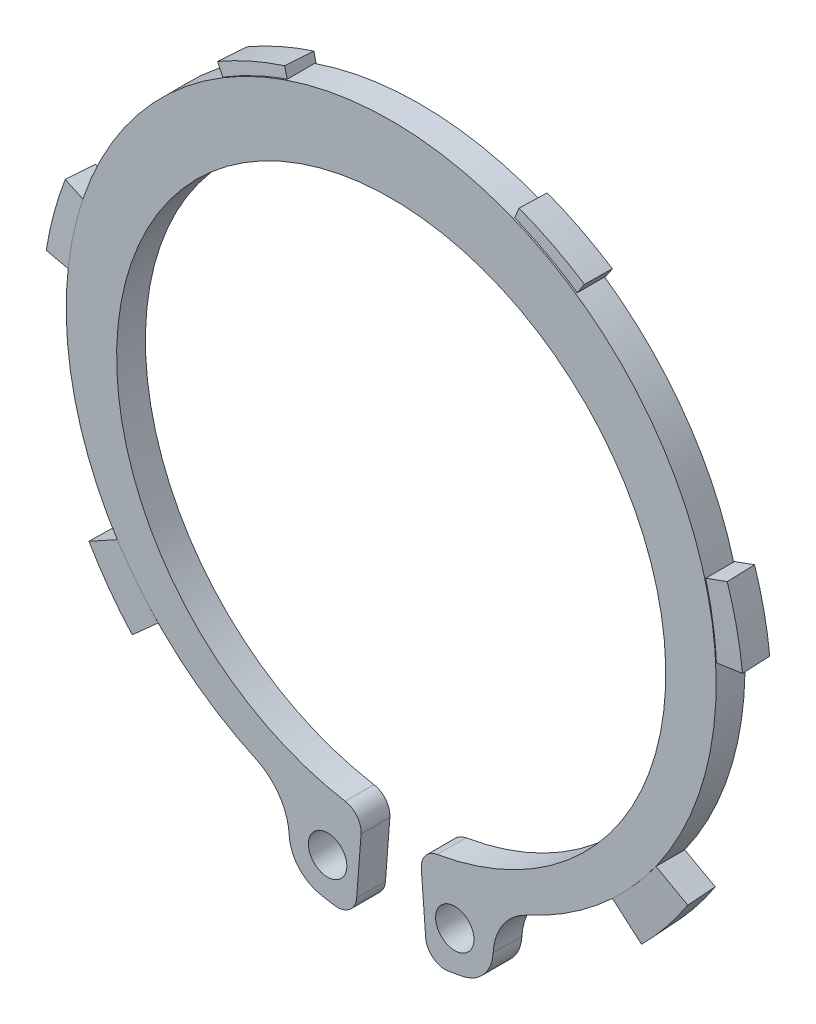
ISO-10303-21;
HEADER;
FILE_DESCRIPTION(('STEP AP214'),'2;1');
FILE_NAME('part.step','',(''),(''),'','','');
FILE_SCHEMA(('AUTOMOTIVE_DESIGN { 1 0 10303 214 1 1 1 1 }'));
ENDSEC;
DATA;
#1=APPLICATION_CONTEXT('core data for automotive mechanical design processes');
#2=APPLICATION_PROTOCOL_DEFINITION('international standard','automotive_design',2000,#1);
#3=PRODUCT_CONTEXT('',#1,'mechanical');
#4=PRODUCT('Part','Part','',(#3));
#5=PRODUCT_RELATED_PRODUCT_CATEGORY('part','',(#4));
#6=PRODUCT_DEFINITION_FORMATION('','',#4);
#7=PRODUCT_DEFINITION_CONTEXT('part definition',#1,'design');
#8=PRODUCT_DEFINITION('design','',#6,#7);
#9=PRODUCT_DEFINITION_SHAPE('','',#8);
#10=(LENGTH_UNIT() NAMED_UNIT(*) SI_UNIT(.MILLI.,.METRE.));
#11=(NAMED_UNIT(*) PLANE_ANGLE_UNIT() SI_UNIT($,.RADIAN.));
#12=(NAMED_UNIT(*) SI_UNIT($,.STERADIAN.) SOLID_ANGLE_UNIT());
#13=UNCERTAINTY_MEASURE_WITH_UNIT(LENGTH_MEASURE(1.E-05),#10,'distance_accuracy_value','');
#14=(GEOMETRIC_REPRESENTATION_CONTEXT(3) GLOBAL_UNCERTAINTY_ASSIGNED_CONTEXT((#13)) GLOBAL_UNIT_ASSIGNED_CONTEXT((#10,
#11,#12)) REPRESENTATION_CONTEXT('',''));
#15=CARTESIAN_POINT('',(0.,0.,0.));
#16=DIRECTION('',(0.,0.,1.));
#17=DIRECTION('',(1.,0.,0.));
#18=AXIS2_PLACEMENT_3D('',#15,#16,#17);
#19=CARTESIAN_POINT('',(0.,0.,0.));
#20=DIRECTION('',(0.,0.,1.));
#21=DIRECTION('',(1.,0.,0.));
#22=AXIS2_PLACEMENT_3D('',#19,#20,#21);
#23=PLANE('',#22);
#24=CARTESIAN_POINT('',(-3.31198552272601,-16.9784583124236,0.));
#25=DIRECTION('',(0.,0.,1.));
#26=DIRECTION('',(-1.,0.,0.));
#27=AXIS2_PLACEMENT_3D('',#24,#25,#26);
#28=CIRCLE('',#27,1.);
#29=CARTESIAN_POINT('',(-4.31198552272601,-16.9784583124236,0.));
#30=VERTEX_POINT('',#29);
#31=EDGE_CURVE('E627',#30,#30,#28,.T.);
#32=ORIENTED_EDGE('',*,*,#31,.T.);
#33=EDGE_LOOP('',(#32));
#34=FACE_BOUND('',#33,.T.);
#35=CARTESIAN_POINT('',(3.31198552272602,-16.9784583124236,0.));
#36=DIRECTION('',(0.,0.,1.));
#37=DIRECTION('',(1.,0.,0.));
#38=AXIS2_PLACEMENT_3D('',#35,#36,#37);
#39=CIRCLE('',#38,1.);
#40=CARTESIAN_POINT('',(4.31198552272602,-16.9784583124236,0.));
#41=VERTEX_POINT('',#40);
#42=EDGE_CURVE('E1221',#41,#41,#39,.T.);
#43=ORIENTED_EDGE('',*,*,#42,.T.);
#44=EDGE_LOOP('',(#43));
#45=FACE_BOUND('',#44,.T.);
#46=CARTESIAN_POINT('',(0.,0.,0.));
#47=DIRECTION('',(0.,0.,1.));
#48=DIRECTION('',(1.,0.,0.));
#49=AXIS2_PLACEMENT_3D('',#46,#47,#48);
#50=CIRCLE('',#49,19.2984766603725);
#51=CARTESIAN_POINT('',(2.94734469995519,-19.0720832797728,0.));
#52=VERTEX_POINT('',#51);
#53=CARTESIAN_POINT('',(3.69490774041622,-18.941458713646,0.));
#54=VERTEX_POINT('',#53);
#55=EDGE_CURVE('E624',#52,#54,#50,.T.);
#56=ORIENTED_EDGE('',*,*,#55,.F.);
#57=CARTESIAN_POINT('',(2.79462048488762,-18.083814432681,0.));
#58=DIRECTION('',(0.,0.,1.));
#59=DIRECTION('',(1.,0.,0.));
#60=AXIS2_PLACEMENT_3D('',#57,#58,#59);
#61=CIRCLE('',#60,1.);
#62=CARTESIAN_POINT('',(1.79752155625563,-18.1599309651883,0.));
#63=VERTEX_POINT('',#62);
#64=EDGE_CURVE('E589',#52,#63,#61,.F.);
#65=ORIENTED_EDGE('',*,*,#64,.T.);
#66=DIRECTION('',(0.076116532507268,-0.997098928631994,0.));
#67=VECTOR('',#66,1.);
#68=CARTESIAN_POINT('',(1.49686515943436,-14.2214413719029,0.));
#69=LINE('',#68,#67);
#70=CARTESIAN_POINT('',(1.56847311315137,-15.1594795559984,0.));
#71=VERTEX_POINT('',#70);
#72=EDGE_CURVE('E620',#71,#63,#69,.T.);
#73=ORIENTED_EDGE('',*,*,#72,.F.);
#74=CARTESIAN_POINT('',(2.56557204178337,-15.0833630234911,0.));
#75=DIRECTION('',(0.,0.,1.));
#76=DIRECTION('',(1.,0.,0.));
#77=AXIS2_PLACEMENT_3D('',#74,#75,#76);
#78=CIRCLE('',#77,1.);
#79=CARTESIAN_POINT('',(2.39788759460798,-14.0975223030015,0.));
#80=VERTEX_POINT('',#79);
#81=EDGE_CURVE('E585',#71,#80,#78,.F.);
#82=ORIENTED_EDGE('',*,*,#81,.T.);
#83=CARTESIAN_POINT('',(0.,0.,0.));
#84=DIRECTION('',(0.,0.,-1.));
#85=DIRECTION('',(1.,0.,0.));
#86=AXIS2_PLACEMENT_3D('',#83,#84,#85);
#87=CIRCLE('',#86,14.3);
#88=CARTESIAN_POINT('',(-2.39788759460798,-14.0975223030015,0.));
#89=VERTEX_POINT('',#88);
#90=EDGE_CURVE('E612',#89,#80,#87,.T.);
#91=ORIENTED_EDGE('',*,*,#90,.F.);
#92=CARTESIAN_POINT('',(-2.56557204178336,-15.0833630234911,0.));
#93=DIRECTION('',(0.,0.,1.));
#94=DIRECTION('',(1.,0.,0.));
#95=AXIS2_PLACEMENT_3D('',#92,#93,#94);
#96=CIRCLE('',#95,1.);
#97=CARTESIAN_POINT('',(-1.56847311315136,-15.1594795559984,0.));
#98=VERTEX_POINT('',#97);
#99=EDGE_CURVE('E583',#89,#98,#96,.F.);
#100=ORIENTED_EDGE('',*,*,#99,.T.);
#101=DIRECTION('',(0.0761165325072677,0.997098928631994,0.));
#102=VECTOR('',#101,1.);
#103=CARTESIAN_POINT('',(-1.49686515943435,-14.2214413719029,0.));
#104=LINE('',#103,#102);
#105=CARTESIAN_POINT('',(-1.79752155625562,-18.1599309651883,0.));
#106=VERTEX_POINT('',#105);
#107=EDGE_CURVE('E648',#106,#98,#104,.T.);
#108=ORIENTED_EDGE('',*,*,#107,.F.);
#109=CARTESIAN_POINT('',(-2.79462048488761,-18.083814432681,0.));
#110=DIRECTION('',(0.,0.,1.));
#111=DIRECTION('',(1.,0.,0.));
#112=AXIS2_PLACEMENT_3D('',#109,#110,#111);
#113=CIRCLE('',#112,1.);
#114=CARTESIAN_POINT('',(-2.94734469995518,-19.0720832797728,0.));
#115=VERTEX_POINT('',#114);
#116=EDGE_CURVE('E587',#106,#115,#113,.F.);
#117=ORIENTED_EDGE('',*,*,#116,.T.);
#118=CARTESIAN_POINT('',(0.,0.,0.));
#119=DIRECTION('',(0.,0.,1.));
#120=DIRECTION('',(-1.,0.,0.));
#121=AXIS2_PLACEMENT_3D('',#118,#119,#120);
#122=CIRCLE('',#121,19.2984766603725);
#123=CARTESIAN_POINT('',(-3.69490774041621,-18.941458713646,0.));
#124=VERTEX_POINT('',#123);
#125=EDGE_CURVE('E645',#124,#115,#122,.T.);
#126=ORIENTED_EDGE('',*,*,#125,.F.);
#127=CARTESIAN_POINT('',(-3.31198552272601,-16.9784583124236,0.));
#128=DIRECTION('',(0.,0.,1.));
#129=DIRECTION('',(-1.,0.,0.));
#130=AXIS2_PLACEMENT_3D('',#127,#128,#129);
#131=CIRCLE('',#130,2.);
#132=CARTESIAN_POINT('',(-5.30931985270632,-17.0816841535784,0.));
#133=VERTEX_POINT('',#132);
#134=EDGE_CURVE('E643',#133,#124,#131,.T.);
#135=ORIENTED_EDGE('',*,*,#134,.F.);
#136=CARTESIAN_POINT('',(-8.30532134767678,-17.2365229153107,0.));
#137=DIRECTION('',(0.,0.,-1.));
#138=DIRECTION('',(-1.,0.,0.));
#139=AXIS2_PLACEMENT_3D('',#136,#137,#138);
#140=CIRCLE('',#139,3.);
#141=CARTESIAN_POINT('',(-7.05483381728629,-14.5095683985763,0.));
#142=VERTEX_POINT('',#141);
#143=EDGE_CURVE('E640',#142,#133,#140,.T.);
#144=ORIENTED_EDGE('',*,*,#143,.F.);
#145=CARTESIAN_POINT('',(0.,0.875,0.));
#146=DIRECTION('',(0.,0.,1.));
#147=DIRECTION('',(1.,0.,0.));
#148=AXIS2_PLACEMENT_3D('',#145,#146,#147);
#149=CIRCLE('',#148,16.925);
#150=CARTESIAN_POINT('',(-12.1333366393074,-10.9249053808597,0.));
#151=VERTEX_POINT('',#150);
#152=EDGE_CURVE('E636',#151,#142,#149,.T.);
#153=ORIENTED_EDGE('',*,*,#152,.F.);
#154=DIRECTION('',(-0.743144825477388,-0.669130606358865,0.));
#155=VECTOR('',#154,1.);
#156=CARTESIAN_POINT('',(0.,0.,0.));
#157=LINE('',#156,#155);
#158=CARTESIAN_POINT('',(-12.1095216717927,-10.9034622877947,0.));
#159=VERTEX_POINT('',#158);
#160=EDGE_CURVE('E352',#159,#151,#157,.T.);
#161=ORIENTED_EDGE('',*,*,#160,.F.);
#162=CARTESIAN_POINT('',(0.,0.,0.));
#163=DIRECTION('',(0.,0.,-1.));
#164=DIRECTION('',(0.258819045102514,0.96592582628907,0.));
#165=AXIS2_PLACEMENT_3D('',#162,#163,#164);
#166=CIRCLE('',#165,16.2949687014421);
#167=CARTESIAN_POINT('',(-14.1118568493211,-8.14748435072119,0.));
#168=VERTEX_POINT('',#167);
#169=EDGE_CURVE('E342',#159,#168,#166,.T.);
#170=ORIENTED_EDGE('',*,*,#169,.T.);
#171=DIRECTION('',(-0.866025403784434,-0.500000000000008,0.));
#172=VECTOR('',#171,1.);
#173=CARTESIAN_POINT('',(0.,0.,0.));
#174=LINE('',#173,#172);
#175=CARTESIAN_POINT('',(-14.2638955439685,-8.23526393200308,0.));
#176=VERTEX_POINT('',#175);
#177=EDGE_CURVE('E347',#168,#176,#174,.T.);
#178=ORIENTED_EDGE('',*,*,#177,.T.);
#179=CARTESIAN_POINT('',(-16.8300128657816,2.66561216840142,0.));
#180=VERTEX_POINT('',#179);
#181=EDGE_CURVE('E782',#180,#176,#149,.T.);
#182=ORIENTED_EDGE('',*,*,#181,.F.);
#183=DIRECTION('',(-0.987688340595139,0.156434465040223,0.));
#184=VECTOR('',#183,1.);
#185=CARTESIAN_POINT('',(0.,0.,0.));
#186=LINE('',#185,#184);
#187=CARTESIAN_POINT('',(-16.0943505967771,2.54909471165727,0.));
#188=VERTEX_POINT('',#187);
#189=EDGE_CURVE('E405',#188,#180,#186,.T.);
#190=ORIENTED_EDGE('',*,*,#189,.F.);
#191=CARTESIAN_POINT('',(0.,0.,0.));
#192=DIRECTION('',(0.,0.,-1.));
#193=DIRECTION('',(0.913545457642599,0.406736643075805,0.));
#194=AXIS2_PLACEMENT_3D('',#191,#192,#193);
#195=CIRCLE('',#194,16.2949687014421);
#196=CARTESIAN_POINT('',(-15.2126638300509,5.83959452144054,0.));
#197=VERTEX_POINT('',#196);
#198=EDGE_CURVE('E867',#188,#197,#195,.T.);
#199=ORIENTED_EDGE('',*,*,#198,.T.);
#200=DIRECTION('',(-0.933580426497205,0.358367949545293,0.));
#201=VECTOR('',#200,1.);
#202=CARTESIAN_POINT('',(0.,0.,0.));
#203=LINE('',#202,#201);
#204=CARTESIAN_POINT('',(-16.0751786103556,6.17068292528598,0.));
#205=VERTEX_POINT('',#204);
#206=EDGE_CURVE('E865',#197,#205,#203,.T.);
#207=ORIENTED_EDGE('',*,*,#206,.T.);
#208=CARTESIAN_POINT('',(-8.83855837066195,15.3088321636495,0.));
#209=VERTEX_POINT('',#208);
#210=EDGE_CURVE('E784',#209,#205,#149,.T.);
#211=ORIENTED_EDGE('',*,*,#210,.F.);
#212=DIRECTION('',(-0.500000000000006,0.866025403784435,0.));
#213=VECTOR('',#212,1.);
#214=CARTESIAN_POINT('',(0.,0.,0.));
#215=LINE('',#214,#213);
#216=CARTESIAN_POINT('',(-8.14748435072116,14.1118568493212,0.));
#217=VERTEX_POINT('',#216);
#218=EDGE_CURVE('E438',#217,#209,#215,.T.);
#219=ORIENTED_EDGE('',*,*,#218,.F.);
#220=CARTESIAN_POINT('',(0.,0.,0.));
#221=DIRECTION('',(0.,0.,-1.));
#222=DIRECTION('',(0.89100652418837,-0.453990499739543,0.));
#223=AXIS2_PLACEMENT_3D('',#220,#221,#222);
#224=CIRCLE('',#223,16.2949687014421);
#225=CARTESIAN_POINT('',(-5.03542225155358,15.4974361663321,0.));
#226=VERTEX_POINT('',#225);
#227=EDGE_CURVE('E427',#217,#226,#224,.T.);
#228=ORIENTED_EDGE('',*,*,#227,.T.);
#229=DIRECTION('',(-0.309016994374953,0.951056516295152,0.));
#230=VECTOR('',#229,1.);
#231=CARTESIAN_POINT('',(0.,0.,0.));
#232=LINE('',#231,#230);
#233=CARTESIAN_POINT('',(-5.48660120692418,16.8860222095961,0.));
#234=VERTEX_POINT('',#233);
#235=EDGE_CURVE('E433',#226,#234,#232,.T.);
#236=ORIENTED_EDGE('',*,*,#235,.T.);
#237=CARTESIAN_POINT('',(6.3570811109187,16.5607624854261,0.));
#238=VERTEX_POINT('',#237);
#239=EDGE_CURVE('E788',#238,#234,#149,.T.);
#240=ORIENTED_EDGE('',*,*,#239,.F.);
#241=DIRECTION('',(0.358367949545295,0.933580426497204,0.));
#242=VECTOR('',#241,1.);
#243=CARTESIAN_POINT('',(0.,0.,0.));
#244=LINE('',#243,#242);
#245=CARTESIAN_POINT('',(5.83959452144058,15.2126638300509,0.));
#246=VERTEX_POINT('',#245);
#247=EDGE_CURVE('E491',#246,#238,#244,.T.);
#248=ORIENTED_EDGE('',*,*,#247,.F.);
#249=CARTESIAN_POINT('',(0.,0.,0.));
#250=DIRECTION('',(0.,0.,-1.));
#251=DIRECTION('',(0.207911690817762,-0.978147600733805,0.));
#252=AXIS2_PLACEMENT_3D('',#249,#250,#251);
#253=CIRCLE('',#252,16.2949687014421);
#254=CARTESIAN_POINT('',(8.87487602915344,13.6661106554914,0.));
#255=VERTEX_POINT('',#254);
#256=EDGE_CURVE('E820',#246,#255,#253,.T.);
#257=ORIENTED_EDGE('',*,*,#256,.T.);
#258=DIRECTION('',(0.544639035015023,0.838670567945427,0.));
#259=VECTOR('',#258,1.);
#260=CARTESIAN_POINT('',(0.,0.,0.));
#261=LINE('',#260,#259);
#262=CARTESIAN_POINT('',(9.61403695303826,14.8043186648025,0.));
#263=VERTEX_POINT('',#262);
#264=EDGE_CURVE('E818',#255,#263,#261,.T.);
#265=ORIENTED_EDGE('',*,*,#264,.T.);
#266=CARTESIAN_POINT('',(16.3343187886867,5.30734189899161,0.));
#267=VERTEX_POINT('',#266);
#268=EDGE_CURVE('E793',#267,#263,#149,.T.);
#269=ORIENTED_EDGE('',*,*,#268,.F.);
#270=DIRECTION('',(0.951056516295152,0.309016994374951,0.));
#271=VECTOR('',#270,1.);
#272=CARTESIAN_POINT('',(0.,0.,0.));
#273=LINE('',#272,#271);
#274=CARTESIAN_POINT('',(15.4974361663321,5.03542225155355,0.));
#275=VERTEX_POINT('',#274);
#276=EDGE_CURVE('E524',#275,#267,#273,.T.);
#277=ORIENTED_EDGE('',*,*,#276,.F.);
#278=CARTESIAN_POINT('',(0.,0.,0.));
#279=DIRECTION('',(0.,0.,-1.));
#280=DIRECTION('',(-0.629320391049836,-0.777145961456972,0.));
#281=AXIS2_PLACEMENT_3D('',#278,#279,#280);
#282=CIRCLE('',#281,16.2949687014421);
#283=CARTESIAN_POINT('',(16.2057031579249,1.70328803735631,0.));
#284=VERTEX_POINT('',#283);
#285=EDGE_CURVE('E513',#275,#284,#282,.T.);
#286=ORIENTED_EDGE('',*,*,#285,.T.);
#287=DIRECTION('',(0.994521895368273,0.104528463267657,0.));
#288=VECTOR('',#287,1.);
#289=CARTESIAN_POINT('',(0.,0.,0.));
#290=LINE('',#289,#288);
#291=CARTESIAN_POINT('',(16.9009812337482,1.77636470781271,0.));
#292=VERTEX_POINT('',#291);
#293=EDGE_CURVE('E519',#284,#292,#290,.T.);
#294=ORIENTED_EDGE('',*,*,#293,.T.);
#295=CARTESIAN_POINT('',(13.7814746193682,-8.94979426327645,0.));
#296=VERTEX_POINT('',#295);
#297=EDGE_CURVE('E641',#296,#292,#149,.T.);
#298=ORIENTED_EDGE('',*,*,#297,.F.);
#299=DIRECTION('',(0.838670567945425,-0.544639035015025,0.));
#300=VECTOR('',#299,1.);
#301=CARTESIAN_POINT('',(0.,0.,0.));
#302=LINE('',#301,#300);
#303=CARTESIAN_POINT('',(13.6661106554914,-8.87487602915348,0.));
#304=VERTEX_POINT('',#303);
#305=EDGE_CURVE('E806',#304,#296,#302,.T.);
#306=ORIENTED_EDGE('',*,*,#305,.F.);
#307=CARTESIAN_POINT('',(0.,0.,0.));
#308=DIRECTION('',(0.,0.,-1.));
#309=DIRECTION('',(-1.,0.,0.));
#310=AXIS2_PLACEMENT_3D('',#307,#308,#309);
#311=CIRCLE('',#310,16.2949687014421);
#312=CARTESIAN_POINT('',(11.5222828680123,-11.5222828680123,0.));
#313=VERTEX_POINT('',#312);
#314=EDGE_CURVE('E1227',#304,#313,#311,.T.);
#315=ORIENTED_EDGE('',*,*,#314,.T.);
#316=CARTESIAN_POINT('',(7.0548338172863,-14.5095683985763,0.));
#317=VERTEX_POINT('',#316);
#318=EDGE_CURVE('E637',#317,#313,#149,.T.);
#319=ORIENTED_EDGE('',*,*,#318,.F.);
#320=CARTESIAN_POINT('',(8.30532134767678,-17.2365229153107,0.));
#321=DIRECTION('',(0.,0.,-1.));
#322=DIRECTION('',(1.,0.,0.));
#323=AXIS2_PLACEMENT_3D('',#320,#321,#322);
#324=CIRCLE('',#323,3.);
#325=CARTESIAN_POINT('',(5.30931985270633,-17.0816841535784,0.));
#326=VERTEX_POINT('',#325);
#327=EDGE_CURVE('E634',#326,#317,#324,.T.);
#328=ORIENTED_EDGE('',*,*,#327,.F.);
#329=CARTESIAN_POINT('',(3.31198552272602,-16.9784583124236,0.));
#330=DIRECTION('',(0.,0.,1.));
#331=DIRECTION('',(1.,0.,0.));
#332=AXIS2_PLACEMENT_3D('',#329,#330,#331);
#333=CIRCLE('',#332,2.);
#334=EDGE_CURVE('E632',#54,#326,#333,.T.);
#335=ORIENTED_EDGE('',*,*,#334,.F.);
#336=EDGE_LOOP('',(#56,#65,#73,#82,#91,#100,#108,#117,#126,#135,#144,#153,#161,#170,#178,#182,
#190,#199,#207,#211,#219,#228,#236,#240,#248,#257,#265,#269,#277,#286,#294,#298,#306,#315,#319,
#328,#335));
#337=FACE_BOUND('',#336,.T.);
#338=ADVANCED_FACE('F30',(#34,#45,#337),#23,.F.);
#339=CARTESIAN_POINT('',(0.,0.875,1.5));
#340=DIRECTION('',(0.,0.,-1.));
#341=DIRECTION('',(-1.,0.,0.));
#342=AXIS2_PLACEMENT_3D('',#339,#340,#341);
#343=CYLINDRICAL_SURFACE('',#342,16.925);
#344=DIRECTION('',(0.,0.,-1.));
#345=VECTOR('',#344,1.);
#346=CARTESIAN_POINT('',(-12.1333366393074,-10.9249053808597,1.5));
#347=LINE('',#346,#345);
#348=CARTESIAN_POINT('',(-12.1333366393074,-10.9249053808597,1.4983303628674));
#349=VERTEX_POINT('',#348);
#350=EDGE_CURVE('E350',#151,#349,#347,.F.);
#351=ORIENTED_EDGE('',*,*,#350,.F.);
#352=ORIENTED_EDGE('',*,*,#152,.T.);
#353=DIRECTION('',(0.,0.,-1.));
#354=VECTOR('',#353,1.);
#355=CARTESIAN_POINT('',(-7.05483381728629,-14.5095683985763,1.5));
#356=LINE('',#355,#354);
#357=CARTESIAN_POINT('',(-7.05483381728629,-14.5095683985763,1.5));
#358=VERTEX_POINT('',#357);
#359=EDGE_CURVE('E679',#358,#142,#356,.T.);
#360=ORIENTED_EDGE('',*,*,#359,.F.);
#361=CARTESIAN_POINT('',(0.,0.875,1.5));
#362=DIRECTION('',(0.,0.,1.));
#363=DIRECTION('',(1.,0.,0.));
#364=AXIS2_PLACEMENT_3D('',#361,#362,#363);
#365=CIRCLE('',#364,16.925);
#366=CARTESIAN_POINT('',(11.5222828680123,-11.5222828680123,1.5));
#367=VERTEX_POINT('',#366);
#368=EDGE_CURVE('E660',#367,#358,#365,.T.);
#369=ORIENTED_EDGE('',*,*,#368,.F.);
#370=CARTESIAN_POINT('',(13.8347187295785,-8.87467602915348,1.49262484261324));
#371=CARTESIAN_POINT('',(13.6654292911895,-9.11490847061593,1.49329114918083));
#372=CARTESIAN_POINT('',(13.489871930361,-9.35072290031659,1.4939459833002));
#373=CARTESIAN_POINT('',(13.1272120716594,-9.81227162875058,1.49522907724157));
#374=CARTESIAN_POINT('',(12.9401420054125,-10.0380314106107,1.49585740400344));
#375=CARTESIAN_POINT('',(12.5545283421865,-10.4795298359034,1.49708746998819));
#376=CARTESIAN_POINT('',(12.3559847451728,-10.6952684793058,1.49768920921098));
#377=CARTESIAN_POINT('',(11.9474151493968,-11.1167190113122,1.49886590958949));
#378=CARTESIAN_POINT('',(11.7373595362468,-11.3224021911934,1.4994407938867));
#379=CARTESIAN_POINT('',(11.5220828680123,-11.5224687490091,1.50000052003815));
#380=B_SPLINE_CURVE_WITH_KNOTS('',3,(#370,#371,#372,#373,#374,#375,#376,#377,#378,#379),
.UNSPECIFIED.,.F.,.F.,(4,2,2,2,4),(0.,0.881567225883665,1.76075563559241,2.63994404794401,
3.52151127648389),.UNSPECIFIED.);
#381=CARTESIAN_POINT('',(13.7814746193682,-8.94979426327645,1.49283321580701));
#382=VERTEX_POINT('',#381);
#383=EDGE_CURVE('E569',#382,#367,#380,.T.);
#384=ORIENTED_EDGE('',*,*,#383,.F.);
#385=DIRECTION('',(0.,0.,-1.));
#386=VECTOR('',#385,1.);
#387=CARTESIAN_POINT('',(13.7814746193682,-8.94979426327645,1.5));
#388=LINE('',#387,#386);
#389=EDGE_CURVE('E576',#296,#382,#388,.F.);
#390=ORIENTED_EDGE('',*,*,#389,.F.);
#391=ORIENTED_EDGE('',*,*,#297,.T.);
#392=DIRECTION('',(0.,0.,-1.));
#393=VECTOR('',#392,1.);
#394=CARTESIAN_POINT('',(16.9009812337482,1.77636470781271,1.5));
#395=LINE('',#394,#393);
#396=CARTESIAN_POINT('',(16.9009812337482,1.77636470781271,1.46357582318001));
#397=VERTEX_POINT('',#396);
#398=EDGE_CURVE('E516',#292,#397,#395,.F.);
#399=ORIENTED_EDGE('',*,*,#398,.T.);
#400=CARTESIAN_POINT('',(16.2366274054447,5.6528191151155,1.45323720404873));
#401=CARTESIAN_POINT('',(16.3312612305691,5.33126300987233,1.45408984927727));
#402=CARTESIAN_POINT('',(16.4163197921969,5.00689074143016,1.45495118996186));
#403=CARTESIAN_POINT('',(16.5667734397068,4.35481491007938,1.45668526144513));
#404=CARTESIAN_POINT('',(16.6322363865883,4.02712700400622,1.45755794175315));
#405=CARTESIAN_POINT('',(16.7436523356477,3.36845108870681,1.45931470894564));
#406=CARTESIAN_POINT('',(16.7896053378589,3.03746307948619,1.46019879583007));
#407=CARTESIAN_POINT('',(16.861984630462,2.37218098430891,1.46197847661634));
#408=CARTESIAN_POINT('',(16.8883416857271,2.03787936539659,1.46287410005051));
#409=CARTESIAN_POINT('',(16.9047299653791,1.70308803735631,1.46377241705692));
#410=B_SPLINE_CURVE_WITH_KNOTS('',3,(#400,#401,#402,#403,#404,#405,#406,#407,#408,#409),
.UNSPECIFIED.,.F.,.F.,(4,2,2,2,4),(0.,1.00542977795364,2.00733629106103,3.00924280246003,
4.01467257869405),.UNSPECIFIED.);
#411=CARTESIAN_POINT('',(16.3343187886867,5.30734189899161,1.45415375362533));
#412=VERTEX_POINT('',#411);
#413=EDGE_CURVE('E526',#412,#397,#410,.T.);
#414=ORIENTED_EDGE('',*,*,#413,.F.);
#415=DIRECTION('',(0.,0.,-1.));
#416=VECTOR('',#415,1.);
#417=CARTESIAN_POINT('',(16.3343187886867,5.30734189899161,1.5));
#418=LINE('',#417,#416);
#419=EDGE_CURVE('E522',#267,#412,#418,.F.);
#420=ORIENTED_EDGE('',*,*,#419,.F.);
#421=ORIENTED_EDGE('',*,*,#268,.T.);
#422=DIRECTION('',(0.,0.,-1.));
#423=VECTOR('',#422,1.);
#424=CARTESIAN_POINT('',(9.61403695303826,14.8043186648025,1.5));
#425=LINE('',#424,#423);
#426=CARTESIAN_POINT('',(9.61403695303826,14.8043186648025,1.42929082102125));
#427=VERTEX_POINT('',#426);
#428=EDGE_CURVE('E824',#263,#427,#425,.F.);
#429=ORIENTED_EDGE('',*,*,#428,.T.);
#430=CARTESIAN_POINT('',(5.83939452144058,16.7607513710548,1.4242519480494));
#431=CARTESIAN_POINT('',(6.20715103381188,16.6255920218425,1.42459911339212));
#432=CARTESIAN_POINT('',(6.57019566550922,16.4776231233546,1.4249793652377));
#433=CARTESIAN_POINT('',(7.28344401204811,16.1576350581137,1.42580227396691));
#434=CARTESIAN_POINT('',(7.63370076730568,15.985734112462,1.42624462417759));
#435=CARTESIAN_POINT('',(8.3215007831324,15.6181440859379,1.42719131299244));
#436=CARTESIAN_POINT('',(8.6590440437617,15.4224550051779,1.42769565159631));
#437=CARTESIAN_POINT('',(9.32140759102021,15.007256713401,1.42876670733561));
#438=CARTESIAN_POINT('',(9.64615905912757,14.787637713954,1.42933371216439));
#439=CARTESIAN_POINT('',(9.96287867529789,14.556983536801,1.42992980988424));
#440=B_SPLINE_CURVE_WITH_KNOTS('',3,(#430,#431,#432,#433,#434,#435,#436,#437,#438,#439),
.UNSPECIFIED.,.F.,.F.,(4,2,2,2,4),(0.,1.17518041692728,2.34474901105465,3.5143175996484,
4.68949801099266),.UNSPECIFIED.);
#441=CARTESIAN_POINT('',(6.3570811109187,16.5607624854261,1.42476576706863));
#442=VERTEX_POINT('',#441);
#443=EDGE_CURVE('E483',#442,#427,#440,.T.);
#444=ORIENTED_EDGE('',*,*,#443,.F.);
#445=DIRECTION('',(0.,0.,-1.));
#446=VECTOR('',#445,1.);
#447=CARTESIAN_POINT('',(6.3570811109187,16.5607624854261,1.5));
#448=LINE('',#447,#446);
#449=EDGE_CURVE('E823',#238,#442,#448,.F.);
#450=ORIENTED_EDGE('',*,*,#449,.F.);
#451=ORIENTED_EDGE('',*,*,#239,.T.);
#452=DIRECTION('',(0.,0.,-1.));
#453=VECTOR('',#452,1.);
#454=CARTESIAN_POINT('',(-5.48660120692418,16.8860222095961,1.5));
#455=LINE('',#454,#453);
#456=CARTESIAN_POINT('',(-5.48660120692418,16.8860222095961,1.42393024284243));
#457=VERTEX_POINT('',#456);
#458=EDGE_CURVE('E430',#234,#457,#455,.F.);
#459=ORIENTED_EDGE('',*,*,#458,.T.);
#460=CARTESIAN_POINT('',(-9.14632985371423,15.1157961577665,1.42848675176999));
#461=CARTESIAN_POINT('',(-8.8265770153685,15.3211842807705,1.42795678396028));
#462=CARTESIAN_POINT('',(-8.49988842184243,15.515768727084,1.42745514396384));
#463=CARTESIAN_POINT('',(-7.83565979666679,15.8816994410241,1.42651245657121));
#464=CARTESIAN_POINT('',(-7.49817514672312,16.0531462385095,1.42607114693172));
#465=CARTESIAN_POINT('',(-6.812472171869,16.3730313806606,1.4252482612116));
#466=CARTESIAN_POINT('',(-6.4642538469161,16.5214697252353,1.42486668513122));
#467=CARTESIAN_POINT('',(-5.75706604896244,16.7953141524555,1.42416311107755));
#468=CARTESIAN_POINT('',(-5.39805512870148,16.920613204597,1.42384138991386));
#469=CARTESIAN_POINT('',(-5.03522225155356,17.0336559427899,1.42355125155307));
#470=B_SPLINE_CURVE_WITH_KNOTS('',3,(#460,#461,#462,#463,#464,#465,#466,#467,#468,#469),
.UNSPECIFIED.,.F.,.F.,(4,2,2,2,4),(0.,1.13988408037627,2.27464407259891,3.40940406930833,
4.54928815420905),.UNSPECIFIED.);
#471=CARTESIAN_POINT('',(-8.83855837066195,15.3088321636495,1.42798878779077));
#472=VERTEX_POINT('',#471);
#473=EDGE_CURVE('E440',#472,#457,#470,.T.);
#474=ORIENTED_EDGE('',*,*,#473,.F.);
#475=DIRECTION('',(0.,0.,-1.));
#476=VECTOR('',#475,1.);
#477=CARTESIAN_POINT('',(-8.83855837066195,15.3088321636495,1.5));
#478=LINE('',#477,#476);
#479=EDGE_CURVE('E436',#209,#472,#478,.F.);
#480=ORIENTED_EDGE('',*,*,#479,.F.);
#481=ORIENTED_EDGE('',*,*,#210,.T.);
#482=DIRECTION('',(0.,0.,-1.));
#483=VECTOR('',#482,1.);
#484=CARTESIAN_POINT('',(-16.0751786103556,6.17068292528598,1.5));
#485=LINE('',#484,#483);
#486=CARTESIAN_POINT('',(-16.0751786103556,6.17068292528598,1.45186506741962));
#487=VERTEX_POINT('',#486);
#488=EDGE_CURVE('E871',#205,#487,#485,.F.);
#489=ORIENTED_EDGE('',*,*,#488,.T.);
#490=CARTESIAN_POINT('',(-16.8420218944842,2.54889471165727,1.46150585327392));
#491=CARTESIAN_POINT('',(-16.8080459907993,2.8908760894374,1.46059058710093));
#492=CARTESIAN_POINT('',(-16.7636286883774,3.23181814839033,1.4596795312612));
#493=CARTESIAN_POINT('',(-16.6543350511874,3.90911886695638,1.45787240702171));
#494=CARTESIAN_POINT('',(-16.5895346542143,4.2454897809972,1.4569762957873));
#495=CARTESIAN_POINT('',(-16.4396448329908,4.91368037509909,1.45519883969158));
#496=CARTESIAN_POINT('',(-16.3545554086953,5.24550005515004,1.4543174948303));
#497=CARTESIAN_POINT('',(-16.1640678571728,5.90458735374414,1.45256942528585));
#498=CARTESIAN_POINT('',(-16.0585958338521,6.23183361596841,1.45170276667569));
#499=CARTESIAN_POINT('',(-15.943238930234,6.55555960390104,1.45084665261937));
#500=B_SPLINE_CURVE_WITH_KNOTS('',3,(#490,#491,#492,#493,#494,#495,#496,#497,#498,#499),
.UNSPECIFIED.,.F.,.F.,(4,2,2,2,4),(0.,1.03083636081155,2.05787691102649,3.08491746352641,
4.11575382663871),.UNSPECIFIED.);
#501=CARTESIAN_POINT('',(-16.8300128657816,2.66561216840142,1.46119353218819));
#502=VERTEX_POINT('',#501);
#503=EDGE_CURVE('E397',#502,#487,#500,.T.);
#504=ORIENTED_EDGE('',*,*,#503,.F.);
#505=DIRECTION('',(0.,0.,-1.));
#506=VECTOR('',#505,1.);
#507=CARTESIAN_POINT('',(-16.8300128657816,2.66561216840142,1.5));
#508=LINE('',#507,#506);
#509=EDGE_CURVE('E870',#180,#502,#508,.F.);
#510=ORIENTED_EDGE('',*,*,#509,.F.);
#511=ORIENTED_EDGE('',*,*,#181,.T.);
#512=DIRECTION('',(0.,0.,-1.));
#513=VECTOR('',#512,1.);
#514=CARTESIAN_POINT('',(-14.2638955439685,-8.23526393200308,1.5));
#515=LINE('',#514,#513);
#516=CARTESIAN_POINT('',(-14.2638955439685,-8.23526393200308,1.49085320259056));
#517=VERTEX_POINT('',#516);
#518=EDGE_CURVE('E345',#176,#517,#515,.F.);
#519=ORIENTED_EDGE('',*,*,#518,.T.);
#520=CARTESIAN_POINT('',(-12.1093216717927,-10.9495487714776,1.49839917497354));
#521=CARTESIAN_POINT('',(-12.317798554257,-10.7360615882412,1.49780302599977));
#522=CARTESIAN_POINT('',(-12.5206184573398,-10.5170515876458,1.49719208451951));
#523=CARTESIAN_POINT('',(-12.9138542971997,-10.0692439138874,1.49594430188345));
#524=CARTESIAN_POINT('',(-13.1043031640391,-9.84047515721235,1.49530753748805));
#525=CARTESIAN_POINT('',(-13.4728725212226,-9.37321327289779,1.49400845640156));
#526=CARTESIAN_POINT('',(-13.6509930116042,-9.13472014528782,1.49334613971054));
#527=CARTESIAN_POINT('',(-13.9948980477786,-8.64800133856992,1.49199610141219));
#528=CARTESIAN_POINT('',(-14.1606468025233,-8.39975037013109,1.49130831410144));
#529=CARTESIAN_POINT('',(-14.3197070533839,-8.1472843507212,1.49060972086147));
#530=B_SPLINE_CURVE_WITH_KNOTS('',3,(#520,#521,#522,#523,#524,#525,#526,#527,#528,#529),
.UNSPECIFIED.,.F.,.F.,(4,2,2,2,4),(0.,0.895080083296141,1.78767069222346,2.68026129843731,
3.57534137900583),.UNSPECIFIED.);
#531=EDGE_CURVE('E315',#349,#517,#530,.T.);
#532=ORIENTED_EDGE('',*,*,#531,.F.);
#533=EDGE_LOOP('',(#351,#352,#360,#369,#384,#390,#391,#399,#414,#420,#421,#429,#444,#450,#451,
#459,#474,#480,#481,#489,#504,#510,#511,#519,#532));
#534=FACE_BOUND('',#533,.T.);
#535=ADVANCED_FACE('F734',(#534),#343,.T.);
#536=CARTESIAN_POINT('',(0.,0.,1.5));
#537=DIRECTION('',(0.,0.,1.));
#538=DIRECTION('',(1.,0.,0.));
#539=AXIS2_PLACEMENT_3D('',#536,#537,#538);
#540=PLANE('',#539);
#541=DIRECTION('',(0.076116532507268,-0.997098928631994,0.));
#542=VECTOR('',#541,1.);
#543=CARTESIAN_POINT('',(1.49686515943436,-14.2214413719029,1.5));
#544=LINE('',#543,#542);
#545=CARTESIAN_POINT('',(1.56847311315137,-15.1594795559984,1.5));
#546=VERTEX_POINT('',#545);
#547=CARTESIAN_POINT('',(1.79752155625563,-18.1599309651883,1.5));
#548=VERTEX_POINT('',#547);
#549=EDGE_CURVE('E651',#546,#548,#544,.T.);
#550=ORIENTED_EDGE('',*,*,#549,.T.);
#551=CARTESIAN_POINT('',(2.79462048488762,-18.083814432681,1.5));
#552=DIRECTION('',(0.,0.,1.));
#553=DIRECTION('',(1.,0.,0.));
#554=AXIS2_PLACEMENT_3D('',#551,#552,#553);
#555=CIRCLE('',#554,1.);
#556=CARTESIAN_POINT('',(2.94734469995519,-19.0720832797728,1.5));
#557=VERTEX_POINT('',#556);
#558=EDGE_CURVE('E601',#548,#557,#555,.T.);
#559=ORIENTED_EDGE('',*,*,#558,.T.);
#560=CARTESIAN_POINT('',(0.,0.,1.5));
#561=DIRECTION('',(0.,0.,1.));
#562=DIRECTION('',(1.,0.,0.));
#563=AXIS2_PLACEMENT_3D('',#560,#561,#562);
#564=CIRCLE('',#563,19.2984766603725);
#565=CARTESIAN_POINT('',(3.69490774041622,-18.941458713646,1.5));
#566=VERTEX_POINT('',#565);
#567=EDGE_CURVE('E654',#557,#566,#564,.T.);
#568=ORIENTED_EDGE('',*,*,#567,.T.);
#569=CARTESIAN_POINT('',(3.31198552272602,-16.9784583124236,1.5));
#570=DIRECTION('',(0.,0.,1.));
#571=DIRECTION('',(1.,0.,0.));
#572=AXIS2_PLACEMENT_3D('',#569,#570,#571);
#573=CIRCLE('',#572,2.);
#574=CARTESIAN_POINT('',(5.30931985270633,-17.0816841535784,1.5));
#575=VERTEX_POINT('',#574);
#576=EDGE_CURVE('E656',#566,#575,#573,.T.);
#577=ORIENTED_EDGE('',*,*,#576,.T.);
#578=CARTESIAN_POINT('',(8.30532134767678,-17.2365229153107,1.5));
#579=DIRECTION('',(0.,0.,-1.));
#580=DIRECTION('',(1.,0.,0.));
#581=AXIS2_PLACEMENT_3D('',#578,#579,#580);
#582=CIRCLE('',#581,3.);
#583=CARTESIAN_POINT('',(7.0548338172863,-14.5095683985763,1.5));
#584=VERTEX_POINT('',#583);
#585=EDGE_CURVE('E658',#575,#584,#582,.T.);
#586=ORIENTED_EDGE('',*,*,#585,.T.);
#587=EDGE_CURVE('E661',#584,#367,#365,.T.);
#588=ORIENTED_EDGE('',*,*,#587,.T.);
#589=ORIENTED_EDGE('',*,*,#368,.T.);
#590=CARTESIAN_POINT('',(-8.30532134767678,-17.2365229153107,1.5));
#591=DIRECTION('',(0.,0.,-1.));
#592=DIRECTION('',(-1.,0.,0.));
#593=AXIS2_PLACEMENT_3D('',#590,#591,#592);
#594=CIRCLE('',#593,3.);
#595=CARTESIAN_POINT('',(-5.30931985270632,-17.0816841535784,1.5));
#596=VERTEX_POINT('',#595);
#597=EDGE_CURVE('E664',#358,#596,#594,.T.);
#598=ORIENTED_EDGE('',*,*,#597,.T.);
#599=CARTESIAN_POINT('',(-3.31198552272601,-16.9784583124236,1.5));
#600=DIRECTION('',(0.,0.,1.));
#601=DIRECTION('',(-1.,0.,0.));
#602=AXIS2_PLACEMENT_3D('',#599,#600,#601);
#603=CIRCLE('',#602,2.);
#604=CARTESIAN_POINT('',(-3.69490774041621,-18.941458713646,1.5));
#605=VERTEX_POINT('',#604);
#606=EDGE_CURVE('E666',#596,#605,#603,.T.);
#607=ORIENTED_EDGE('',*,*,#606,.T.);
#608=CARTESIAN_POINT('',(0.,0.,1.5));
#609=DIRECTION('',(0.,0.,1.));
#610=DIRECTION('',(-1.,0.,0.));
#611=AXIS2_PLACEMENT_3D('',#608,#609,#610);
#612=CIRCLE('',#611,19.2984766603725);
#613=CARTESIAN_POINT('',(-2.94734469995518,-19.0720832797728,1.5));
#614=VERTEX_POINT('',#613);
#615=EDGE_CURVE('E668',#605,#614,#612,.T.);
#616=ORIENTED_EDGE('',*,*,#615,.T.);
#617=CARTESIAN_POINT('',(-2.79462048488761,-18.083814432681,1.5));
#618=DIRECTION('',(0.,0.,1.));
#619=DIRECTION('',(1.,0.,0.));
#620=AXIS2_PLACEMENT_3D('',#617,#618,#619);
#621=CIRCLE('',#620,1.);
#622=CARTESIAN_POINT('',(-1.79752155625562,-18.1599309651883,1.5));
#623=VERTEX_POINT('',#622);
#624=EDGE_CURVE('E599',#614,#623,#621,.T.);
#625=ORIENTED_EDGE('',*,*,#624,.T.);
#626=DIRECTION('',(0.0761165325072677,0.997098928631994,0.));
#627=VECTOR('',#626,1.);
#628=CARTESIAN_POINT('',(-1.49686515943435,-14.2214413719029,1.5));
#629=LINE('',#628,#627);
#630=CARTESIAN_POINT('',(-1.56847311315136,-15.1594795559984,1.5));
#631=VERTEX_POINT('',#630);
#632=EDGE_CURVE('E671',#623,#631,#629,.T.);
#633=ORIENTED_EDGE('',*,*,#632,.T.);
#634=CARTESIAN_POINT('',(-2.56557204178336,-15.0833630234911,1.5));
#635=DIRECTION('',(0.,0.,1.));
#636=DIRECTION('',(1.,0.,0.));
#637=AXIS2_PLACEMENT_3D('',#634,#635,#636);
#638=CIRCLE('',#637,1.);
#639=CARTESIAN_POINT('',(-2.39788759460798,-14.0975223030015,1.5));
#640=VERTEX_POINT('',#639);
#641=EDGE_CURVE('E50',#631,#640,#638,.T.);
#642=ORIENTED_EDGE('',*,*,#641,.T.);
#643=CARTESIAN_POINT('',(0.,0.,1.5));
#644=DIRECTION('',(0.,0.,-1.));
#645=DIRECTION('',(1.,0.,0.));
#646=AXIS2_PLACEMENT_3D('',#643,#644,#645);
#647=CIRCLE('',#646,14.3);
#648=CARTESIAN_POINT('',(2.39788759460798,-14.0975223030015,1.5));
#649=VERTEX_POINT('',#648);
#650=EDGE_CURVE('E613',#640,#649,#647,.T.);
#651=ORIENTED_EDGE('',*,*,#650,.T.);
#652=CARTESIAN_POINT('',(2.56557204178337,-15.0833630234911,1.5));
#653=DIRECTION('',(0.,0.,1.));
#654=DIRECTION('',(1.,0.,0.));
#655=AXIS2_PLACEMENT_3D('',#652,#653,#654);
#656=CIRCLE('',#655,1.);
#657=EDGE_CURVE('E597',#649,#546,#656,.T.);
#658=ORIENTED_EDGE('',*,*,#657,.T.);
#659=EDGE_LOOP('',(#550,#559,#568,#577,#586,#588,#589,#598,#607,#616,#625,#633,#642,#651,#658));
#660=FACE_BOUND('',#659,.T.);
#661=CARTESIAN_POINT('',(-3.31198552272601,-16.9784583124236,1.5));
#662=DIRECTION('',(0.,0.,1.));
#663=DIRECTION('',(-1.,0.,0.));
#664=AXIS2_PLACEMENT_3D('',#661,#662,#663);
#665=CIRCLE('',#664,1.);
#666=CARTESIAN_POINT('',(-4.31198552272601,-16.9784583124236,1.5));
#667=VERTEX_POINT('',#666);
#668=EDGE_CURVE('E621',#667,#667,#665,.T.);
#669=ORIENTED_EDGE('',*,*,#668,.F.);
#670=EDGE_LOOP('',(#669));
#671=FACE_BOUND('',#670,.T.);
#672=CARTESIAN_POINT('',(3.31198552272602,-16.9784583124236,1.5));
#673=DIRECTION('',(0.,0.,1.));
#674=DIRECTION('',(1.,0.,0.));
#675=AXIS2_PLACEMENT_3D('',#672,#673,#674);
#676=CIRCLE('',#675,1.);
#677=CARTESIAN_POINT('',(4.31198552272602,-16.9784583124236,1.5));
#678=VERTEX_POINT('',#677);
#679=EDGE_CURVE('E1219',#678,#678,#676,.T.);
#680=ORIENTED_EDGE('',*,*,#679,.F.);
#681=EDGE_LOOP('',(#680));
#682=FACE_BOUND('',#681,.T.);
#683=ADVANCED_FACE('F707',(#660,#671,#682),#540,.T.);
#684=CARTESIAN_POINT('',(0.,0.,1.5));
#685=DIRECTION('',(0.,0.,-1.));
#686=DIRECTION('',(-1.,0.,0.));
#687=AXIS2_PLACEMENT_3D('',#684,#685,#686);
#688=CYLINDRICAL_SURFACE('',#687,14.3);
#689=ORIENTED_EDGE('',*,*,#90,.T.);
#690=DIRECTION('',(0.,0.,-1.));
#691=VECTOR('',#690,1.);
#692=CARTESIAN_POINT('',(2.39788759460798,-14.0975223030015,1.5));
#693=LINE('',#692,#691);
#694=EDGE_CURVE('E11',#80,#649,#693,.F.);
#695=ORIENTED_EDGE('',*,*,#694,.T.);
#696=ORIENTED_EDGE('',*,*,#650,.F.);
#697=DIRECTION('',(0.,0.,-1.));
#698=VECTOR('',#697,1.);
#699=CARTESIAN_POINT('',(-2.39788759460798,-14.0975223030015,1.5));
#700=LINE('',#699,#698);
#701=EDGE_CURVE('E38',#640,#89,#700,.T.);
#702=ORIENTED_EDGE('',*,*,#701,.T.);
#703=EDGE_LOOP('',(#689,#695,#696,#702));
#704=FACE_BOUND('',#703,.T.);
#705=ADVANCED_FACE('F32',(#704),#688,.F.);
#706=CARTESIAN_POINT('',(1.49686515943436,-14.2214413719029,1.5));
#707=DIRECTION('',(0.997098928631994,0.076116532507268,0.));
#708=DIRECTION('',(-0.076116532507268,0.997098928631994,0.));
#709=AXIS2_PLACEMENT_3D('',#706,#707,#708);
#710=PLANE('',#709);
#711=ORIENTED_EDGE('',*,*,#72,.T.);
#712=DIRECTION('',(0.,0.,-1.));
#713=VECTOR('',#712,1.);
#714=CARTESIAN_POINT('',(1.79752155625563,-18.1599309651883,1.5));
#715=LINE('',#714,#713);
#716=EDGE_CURVE('E594',#63,#548,#715,.F.);
#717=ORIENTED_EDGE('',*,*,#716,.T.);
#718=ORIENTED_EDGE('',*,*,#549,.F.);
#719=DIRECTION('',(0.,0.,-1.));
#720=VECTOR('',#719,1.);
#721=CARTESIAN_POINT('',(1.56847311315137,-15.1594795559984,1.5));
#722=LINE('',#721,#720);
#723=EDGE_CURVE('E591',#546,#71,#722,.T.);
#724=ORIENTED_EDGE('',*,*,#723,.T.);
#725=EDGE_LOOP('',(#711,#717,#718,#724));
#726=FACE_BOUND('',#725,.T.);
#727=ADVANCED_FACE('F716',(#726),#710,.F.);
#728=CARTESIAN_POINT('',(0.,0.,1.5));
#729=DIRECTION('',(0.,0.,-1.));
#730=DIRECTION('',(-1.,0.,0.));
#731=AXIS2_PLACEMENT_3D('',#728,#729,#730);
#732=CYLINDRICAL_SURFACE('',#731,19.2984766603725);
#733=ORIENTED_EDGE('',*,*,#567,.F.);
#734=DIRECTION('',(0.,0.,-1.));
#735=VECTOR('',#734,1.);
#736=CARTESIAN_POINT('',(2.94734469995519,-19.0720832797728,1.5));
#737=LINE('',#736,#735);
#738=EDGE_CURVE('E580',#557,#52,#737,.T.);
#739=ORIENTED_EDGE('',*,*,#738,.T.);
#740=ORIENTED_EDGE('',*,*,#55,.T.);
#741=DIRECTION('',(0.,0.,-1.));
#742=VECTOR('',#741,1.);
#743=CARTESIAN_POINT('',(3.69490774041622,-18.941458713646,1.5));
#744=LINE('',#743,#742);
#745=EDGE_CURVE('E577',#566,#54,#744,.T.);
#746=ORIENTED_EDGE('',*,*,#745,.F.);
#747=EDGE_LOOP('',(#733,#739,#740,#746));
#748=FACE_BOUND('',#747,.T.);
#749=ADVANCED_FACE('F712',(#748),#732,.T.);
#750=CARTESIAN_POINT('',(3.31198552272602,-16.9784583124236,1.5));
#751=DIRECTION('',(0.,0.,-1.));
#752=DIRECTION('',(-1.,0.,0.));
#753=AXIS2_PLACEMENT_3D('',#750,#751,#752);
#754=CYLINDRICAL_SURFACE('',#753,2.);
#755=ORIENTED_EDGE('',*,*,#334,.T.);
#756=DIRECTION('',(0.,0.,-1.));
#757=VECTOR('',#756,1.);
#758=CARTESIAN_POINT('',(5.30931985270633,-17.0816841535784,1.5));
#759=LINE('',#758,#757);
#760=EDGE_CURVE('E684',#575,#326,#759,.T.);
#761=ORIENTED_EDGE('',*,*,#760,.F.);
#762=ORIENTED_EDGE('',*,*,#576,.F.);
#763=ORIENTED_EDGE('',*,*,#745,.T.);
#764=EDGE_LOOP('',(#755,#761,#762,#763));
#765=FACE_BOUND('',#764,.T.);
#766=ADVANCED_FACE('F695',(#765),#754,.T.);
#767=CARTESIAN_POINT('',(8.30532134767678,-17.2365229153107,1.5));
#768=DIRECTION('',(0.,0.,-1.));
#769=DIRECTION('',(-1.,0.,0.));
#770=AXIS2_PLACEMENT_3D('',#767,#768,#769);
#771=CYLINDRICAL_SURFACE('',#770,3.);
#772=ORIENTED_EDGE('',*,*,#327,.T.);
#773=DIRECTION('',(0.,0.,-1.));
#774=VECTOR('',#773,1.);
#775=CARTESIAN_POINT('',(7.0548338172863,-14.5095683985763,1.5));
#776=LINE('',#775,#774);
#777=EDGE_CURVE('E682',#584,#317,#776,.T.);
#778=ORIENTED_EDGE('',*,*,#777,.F.);
#779=ORIENTED_EDGE('',*,*,#585,.F.);
#780=ORIENTED_EDGE('',*,*,#760,.T.);
#781=EDGE_LOOP('',(#772,#778,#779,#780));
#782=FACE_BOUND('',#781,.T.);
#783=ADVANCED_FACE('F701',(#782),#771,.F.);
#784=ORIENTED_EDGE('',*,*,#318,.T.);
#785=DIRECTION('',(0.,0.,1.));
#786=VECTOR('',#785,1.);
#787=CARTESIAN_POINT('',(11.5222828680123,-11.5222828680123,1.5));
#788=LINE('',#787,#786);
#789=EDGE_CURVE('E533',#313,#367,#788,.T.);
#790=ORIENTED_EDGE('',*,*,#789,.T.);
#791=ORIENTED_EDGE('',*,*,#587,.F.);
#792=ORIENTED_EDGE('',*,*,#777,.T.);
#793=EDGE_LOOP('',(#784,#790,#791,#792));
#794=FACE_BOUND('',#793,.T.);
#795=ADVANCED_FACE('F362',(#794),#343,.T.);
#796=CARTESIAN_POINT('',(-8.30532134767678,-17.2365229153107,1.5));
#797=DIRECTION('',(0.,0.,-1.));
#798=DIRECTION('',(-1.,0.,0.));
#799=AXIS2_PLACEMENT_3D('',#796,#797,#798);
#800=CYLINDRICAL_SURFACE('',#799,3.);
#801=ORIENTED_EDGE('',*,*,#143,.T.);
#802=DIRECTION('',(0.,0.,-1.));
#803=VECTOR('',#802,1.);
#804=CARTESIAN_POINT('',(-5.30931985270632,-17.0816841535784,1.5));
#805=LINE('',#804,#803);
#806=EDGE_CURVE('E676',#596,#133,#805,.T.);
#807=ORIENTED_EDGE('',*,*,#806,.F.);
#808=ORIENTED_EDGE('',*,*,#597,.F.);
#809=ORIENTED_EDGE('',*,*,#359,.T.);
#810=EDGE_LOOP('',(#801,#807,#808,#809));
#811=FACE_BOUND('',#810,.T.);
#812=ADVANCED_FACE('F759',(#811),#800,.F.);
#813=CARTESIAN_POINT('',(-3.31198552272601,-16.9784583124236,1.5));
#814=DIRECTION('',(0.,0.,-1.));
#815=DIRECTION('',(-1.,0.,0.));
#816=AXIS2_PLACEMENT_3D('',#813,#814,#815);
#817=CYLINDRICAL_SURFACE('',#816,2.);
#818=ORIENTED_EDGE('',*,*,#134,.T.);
#819=DIRECTION('',(0.,0.,-1.));
#820=VECTOR('',#819,1.);
#821=CARTESIAN_POINT('',(-3.69490774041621,-18.941458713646,1.5));
#822=LINE('',#821,#820);
#823=EDGE_CURVE('E673',#605,#124,#822,.T.);
#824=ORIENTED_EDGE('',*,*,#823,.F.);
#825=ORIENTED_EDGE('',*,*,#606,.F.);
#826=ORIENTED_EDGE('',*,*,#806,.T.);
#827=EDGE_LOOP('',(#818,#824,#825,#826));
#828=FACE_BOUND('',#827,.T.);
#829=ADVANCED_FACE('F756',(#828),#817,.T.);
#830=CARTESIAN_POINT('',(0.,0.,1.5));
#831=DIRECTION('',(0.,0.,-1.));
#832=DIRECTION('',(-1.,0.,0.));
#833=AXIS2_PLACEMENT_3D('',#830,#831,#832);
#834=CYLINDRICAL_SURFACE('',#833,19.2984766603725);
#835=ORIENTED_EDGE('',*,*,#125,.T.);
#836=DIRECTION('',(0.,0.,-1.));
#837=VECTOR('',#836,1.);
#838=CARTESIAN_POINT('',(-2.94734469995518,-19.0720832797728,1.5));
#839=LINE('',#838,#837);
#840=EDGE_CURVE('E608',#115,#614,#839,.F.);
#841=ORIENTED_EDGE('',*,*,#840,.T.);
#842=ORIENTED_EDGE('',*,*,#615,.F.);
#843=ORIENTED_EDGE('',*,*,#823,.T.);
#844=EDGE_LOOP('',(#835,#841,#842,#843));
#845=FACE_BOUND('',#844,.T.);
#846=ADVANCED_FACE('F752',(#845),#834,.T.);
#847=CARTESIAN_POINT('',(-1.49686515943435,-14.2214413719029,1.5));
#848=DIRECTION('',(-0.997098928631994,0.0761165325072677,0.));
#849=DIRECTION('',(-0.0761165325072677,-0.997098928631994,0.));
#850=AXIS2_PLACEMENT_3D('',#847,#848,#849);
#851=PLANE('',#850);
#852=ORIENTED_EDGE('',*,*,#632,.F.);
#853=DIRECTION('',(0.,0.,-1.));
#854=VECTOR('',#853,1.);
#855=CARTESIAN_POINT('',(-1.79752155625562,-18.1599309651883,1.5));
#856=LINE('',#855,#854);
#857=EDGE_CURVE('E605',#623,#106,#856,.T.);
#858=ORIENTED_EDGE('',*,*,#857,.T.);
#859=ORIENTED_EDGE('',*,*,#107,.T.);
#860=DIRECTION('',(0.,0.,-1.));
#861=VECTOR('',#860,1.);
#862=CARTESIAN_POINT('',(-1.56847311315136,-15.1594795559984,1.5));
#863=LINE('',#862,#861);
#864=EDGE_CURVE('E603',#98,#631,#863,.F.);
#865=ORIENTED_EDGE('',*,*,#864,.T.);
#866=EDGE_LOOP('',(#852,#858,#859,#865));
#867=FACE_BOUND('',#866,.T.);
#868=ADVANCED_FACE('F749',(#867),#851,.F.);
#869=CARTESIAN_POINT('',(-3.31198552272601,-16.9784583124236,1.5));
#870=DIRECTION('',(0.,0.,-1.));
#871=DIRECTION('',(-1.,0.,0.));
#872=AXIS2_PLACEMENT_3D('',#869,#870,#871);
#873=CYLINDRICAL_SURFACE('',#872,1.);
#874=ORIENTED_EDGE('',*,*,#668,.T.);
#875=EDGE_LOOP('',(#874));
#876=FACE_BOUND('',#875,.T.);
#877=ORIENTED_EDGE('',*,*,#31,.F.);
#878=EDGE_LOOP('',(#877));
#879=FACE_BOUND('',#878,.T.);
#880=ADVANCED_FACE('F745',(#876,#879),#873,.F.);
#881=CARTESIAN_POINT('',(3.31198552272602,-16.9784583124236,1.5));
#882=DIRECTION('',(0.,0.,-1.));
#883=DIRECTION('',(-1.,0.,0.));
#884=AXIS2_PLACEMENT_3D('',#881,#882,#883);
#885=CYLINDRICAL_SURFACE('',#884,1.);
#886=ORIENTED_EDGE('',*,*,#679,.T.);
#887=EDGE_LOOP('',(#886));
#888=FACE_BOUND('',#887,.T.);
#889=ORIENTED_EDGE('',*,*,#42,.F.);
#890=EDGE_LOOP('',(#889));
#891=FACE_BOUND('',#890,.T.);
#892=ADVANCED_FACE('F565',(#888,#891),#885,.F.);
#893=CARTESIAN_POINT('',(0.,0.,1.5));
#894=DIRECTION('',(0.,0.,-1.));
#895=DIRECTION('',(-1.,0.,0.));
#896=AXIS2_PLACEMENT_3D('',#893,#894,#895);
#897=CONICAL_SURFACE('',#896,16.2949687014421,1.51874245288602);
#898=DIRECTION('',(0.837534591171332,-0.543901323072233,-0.0520303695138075));
#899=VECTOR('',#898,1.);
#900=CARTESIAN_POINT('',(13.6661106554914,-8.87487602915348,1.5));
#901=LINE('',#900,#899);
#902=CARTESIAN_POINT('',(15.3411798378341,-9.96267867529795,1.39593926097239));
#903=VERTEX_POINT('',#902);
#904=EDGE_CURVE('E1239',#382,#903,#901,.T.);
#905=ORIENTED_EDGE('',*,*,#904,.F.);
#906=ORIENTED_EDGE('',*,*,#383,.T.);
#907=DIRECTION('',(0.706149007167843,-0.70614900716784,-0.0520303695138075));
#908=VECTOR('',#907,1.);
#909=CARTESIAN_POINT('',(11.5222828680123,-11.5222828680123,1.5));
#910=LINE('',#909,#908);
#911=CARTESIAN_POINT('',(12.934580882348,-12.9345808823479,1.39593926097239));
#912=VERTEX_POINT('',#911);
#913=EDGE_CURVE('E1245',#367,#912,#910,.T.);
#914=ORIENTED_EDGE('',*,*,#913,.T.);
#915=CARTESIAN_POINT('',(0.,0.,1.39593926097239));
#916=DIRECTION('',(0.,0.,-1.));
#917=DIRECTION('',(-1.,0.,0.));
#918=AXIS2_PLACEMENT_3D('',#915,#916,#917);
#919=CIRCLE('',#918,18.2922597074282);
#920=EDGE_CURVE('E1231',#903,#912,#919,.T.);
#921=ORIENTED_EDGE('',*,*,#920,.F.);
#922=EDGE_LOOP('',(#905,#906,#914,#921));
#923=FACE_BOUND('',#922,.T.);
#924=ADVANCED_FACE('F560',(#923),#897,.T.);
#925=CARTESIAN_POINT('',(13.6661106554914,-8.87487602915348,1.5));
#926=DIRECTION('',(-0.544639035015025,-0.838670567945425,0.));
#927=DIRECTION('',(0.838670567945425,-0.544639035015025,0.));
#928=AXIS2_PLACEMENT_3D('',#925,#926,#927);
#929=PLANE('',#928);
#930=DIRECTION('',(-0.837534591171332,0.543901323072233,0.0520303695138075));
#931=VECTOR('',#930,1.);
#932=CARTESIAN_POINT('',(15.2758139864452,-9.9202295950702,-0.1));
#933=LINE('',#932,#931);
#934=CARTESIAN_POINT('',(15.2758139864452,-9.9202295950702,-0.1));
#935=VERTEX_POINT('',#934);
#936=EDGE_CURVE('E1233',#935,#304,#933,.T.);
#937=ORIENTED_EDGE('',*,*,#936,.T.);
#938=ORIENTED_EDGE('',*,*,#305,.T.);
#939=ORIENTED_EDGE('',*,*,#389,.T.);
#940=ORIENTED_EDGE('',*,*,#904,.T.);
#941=DIRECTION('',(-0.0436363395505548,0.0283377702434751,-0.998645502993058));
#942=VECTOR('',#941,1.);
#943=CARTESIAN_POINT('',(15.3411798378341,-9.96267867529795,1.39593926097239));
#944=LINE('',#943,#942);
#945=EDGE_CURVE('E1236',#903,#935,#944,.T.);
#946=ORIENTED_EDGE('',*,*,#945,.T.);
#947=EDGE_LOOP('',(#937,#938,#939,#940,#946));
#948=FACE_BOUND('',#947,.T.);
#949=ADVANCED_FACE('F556',(#948),#929,.F.);
#950=CARTESIAN_POINT('',(0.,0.,-0.1));
#951=DIRECTION('',(0.,0.,-1.));
#952=DIRECTION('',(-1.,0.,0.));
#953=AXIS2_PLACEMENT_3D('',#950,#951,#952);
#954=CONICAL_SURFACE('',#953,18.2143198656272,1.51874245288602);
#955=CARTESIAN_POINT('',(0.,0.,-0.1));
#956=DIRECTION('',(0.,0.,-1.));
#957=DIRECTION('',(-1.,0.,0.));
#958=AXIS2_PLACEMENT_3D('',#955,#956,#957);
#959=CIRCLE('',#958,18.2143198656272);
#960=CARTESIAN_POINT('',(12.8794690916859,-12.8794690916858,-0.1));
#961=VERTEX_POINT('',#960);
#962=EDGE_CURVE('E1229',#935,#961,#959,.T.);
#963=ORIENTED_EDGE('',*,*,#962,.T.);
#964=DIRECTION('',(-0.706149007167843,0.70614900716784,0.0520303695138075));
#965=VECTOR('',#964,1.);
#966=CARTESIAN_POINT('',(12.8794690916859,-12.8794690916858,-0.1));
#967=LINE('',#966,#965);
#968=EDGE_CURVE('E1241',#961,#313,#967,.T.);
#969=ORIENTED_EDGE('',*,*,#968,.T.);
#970=ORIENTED_EDGE('',*,*,#314,.F.);
#971=ORIENTED_EDGE('',*,*,#936,.F.);
#972=EDGE_LOOP('',(#963,#969,#970,#971));
#973=FACE_BOUND('',#972,.T.);
#974=ADVANCED_FACE('F559',(#973),#954,.F.);
#975=CARTESIAN_POINT('',(0.,0.,1.39593926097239));
#976=DIRECTION('',(0.,0.,1.));
#977=DIRECTION('',(1.,0.,0.));
#978=AXIS2_PLACEMENT_3D('',#975,#976,#977);
#979=CONICAL_SURFACE('',#978,18.2922597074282,0.052053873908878);
#980=ORIENTED_EDGE('',*,*,#920,.T.);
#981=DIRECTION('',(-0.0367910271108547,0.0367910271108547,-0.998645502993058));
#982=VECTOR('',#981,1.);
#983=CARTESIAN_POINT('',(12.934580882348,-12.9345808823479,1.39593926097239));
#984=LINE('',#983,#982);
#985=EDGE_CURVE('E1243',#912,#961,#984,.T.);
#986=ORIENTED_EDGE('',*,*,#985,.T.);
#987=ORIENTED_EDGE('',*,*,#962,.F.);
#988=ORIENTED_EDGE('',*,*,#945,.F.);
#989=EDGE_LOOP('',(#980,#986,#987,#988));
#990=FACE_BOUND('',#989,.T.);
#991=ADVANCED_FACE('F554',(#990),#979,.T.);
#992=CARTESIAN_POINT('',(11.5222828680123,-11.5222828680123,1.5));
#993=DIRECTION('',(-0.707106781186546,-0.707106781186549,0.));
#994=DIRECTION('',(0.707106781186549,-0.707106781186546,0.));
#995=AXIS2_PLACEMENT_3D('',#992,#993,#994);
#996=PLANE('',#995);
#997=ORIENTED_EDGE('',*,*,#789,.F.);
#998=ORIENTED_EDGE('',*,*,#968,.F.);
#999=ORIENTED_EDGE('',*,*,#985,.F.);
#1000=ORIENTED_EDGE('',*,*,#913,.F.);
#1001=EDGE_LOOP('',(#997,#998,#999,#1000));
#1002=FACE_BOUND('',#1001,.T.);
#1003=ADVANCED_FACE('F541',(#1002),#996,.T.);
#1004=CARTESIAN_POINT('',(0.,0.,1.5));
#1005=DIRECTION('',(0.,0.,-1.));
#1006=DIRECTION('',(-0.629320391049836,-0.777145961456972,0.));
#1007=AXIS2_PLACEMENT_3D('',#1004,#1005,#1006);
#1008=CONICAL_SURFACE('',#1007,16.2949687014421,1.51874245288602);
#1009=DIRECTION('',(0.949768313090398,0.308598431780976,-0.0520303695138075));
#1010=VECTOR('',#1009,1.);
#1011=CARTESIAN_POINT('',(15.4974361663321,5.03542225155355,1.5));
#1012=LINE('',#1011,#1010);
#1013=CARTESIAN_POINT('',(17.3969727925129,5.6526191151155,1.39593926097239));
#1014=VERTEX_POINT('',#1013);
#1015=EDGE_CURVE('E500',#412,#1014,#1012,.T.);
#1016=ORIENTED_EDGE('',*,*,#1015,.F.);
#1017=ORIENTED_EDGE('',*,*,#413,.T.);
#1018=DIRECTION('',(0.993174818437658,0.104386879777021,-0.0520303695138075));
#1019=VECTOR('',#1018,1.);
#1020=CARTESIAN_POINT('',(16.2057031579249,1.70328803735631,1.5));
#1021=LINE('',#1020,#1019);
#1022=CARTESIAN_POINT('',(18.1920527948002,1.91206179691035,1.39593926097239));
#1023=VERTEX_POINT('',#1022);
#1024=EDGE_CURVE('E490',#397,#1023,#1021,.T.);
#1025=ORIENTED_EDGE('',*,*,#1024,.T.);
#1026=CARTESIAN_POINT('',(0.,0.,1.39593926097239));
#1027=DIRECTION('',(0.,0.,-1.));
#1028=DIRECTION('',(-0.629320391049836,-0.777145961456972,0.));
#1029=AXIS2_PLACEMENT_3D('',#1026,#1027,#1028);
#1030=CIRCLE('',#1029,18.2922597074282);
#1031=EDGE_CURVE('E508',#1014,#1023,#1030,.T.);
#1032=ORIENTED_EDGE('',*,*,#1031,.F.);
#1033=EDGE_LOOP('',(#1016,#1017,#1025,#1032));
#1034=FACE_BOUND('',#1033,.T.);
#1035=ADVANCED_FACE('F535',(#1034),#1008,.T.);
#1036=CARTESIAN_POINT('',(15.4974361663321,5.03542225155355,1.5));
#1037=DIRECTION('',(0.309016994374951,-0.951056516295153,0.));
#1038=DIRECTION('',(0.951056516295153,0.309016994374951,0.));
#1039=AXIS2_PLACEMENT_3D('',#1036,#1037,#1038);
#1040=PLANE('',#1039);
#1041=DIRECTION('',(-0.949768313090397,-0.308598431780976,0.0520303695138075));
#1042=VECTOR('',#1041,1.);
#1043=CARTESIAN_POINT('',(17.322847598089,5.62853437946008,-0.1));
#1044=LINE('',#1043,#1042);
#1045=CARTESIAN_POINT('',(17.322847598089,5.62853437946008,-0.1));
#1046=VERTEX_POINT('',#1045);
#1047=EDGE_CURVE('E505',#1046,#275,#1044,.T.);
#1048=ORIENTED_EDGE('',*,*,#1047,.T.);
#1049=ORIENTED_EDGE('',*,*,#276,.T.);
#1050=ORIENTED_EDGE('',*,*,#419,.T.);
#1051=ORIENTED_EDGE('',*,*,#1015,.T.);
#1052=DIRECTION('',(-0.0494838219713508,-0.0160782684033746,-0.998645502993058));
#1053=VECTOR('',#1052,1.);
#1054=CARTESIAN_POINT('',(17.3969727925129,5.6526191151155,1.39593926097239));
#1055=LINE('',#1054,#1053);
#1056=EDGE_CURVE('E502',#1014,#1046,#1055,.T.);
#1057=ORIENTED_EDGE('',*,*,#1056,.T.);
#1058=EDGE_LOOP('',(#1048,#1049,#1050,#1051,#1057));
#1059=FACE_BOUND('',#1058,.T.);
#1060=ADVANCED_FACE('F540',(#1059),#1040,.F.);
#1061=CARTESIAN_POINT('',(16.2057031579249,1.70328803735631,1.5));
#1062=DIRECTION('',(0.104528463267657,-0.994521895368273,0.));
#1063=DIRECTION('',(0.994521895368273,0.104528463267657,0.));
#1064=AXIS2_PLACEMENT_3D('',#1061,#1062,#1063);
#1065=PLANE('',#1064);
#1066=ORIENTED_EDGE('',*,*,#293,.F.);
#1067=DIRECTION('',(-0.993174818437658,-0.10438687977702,0.0520303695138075));
#1068=VECTOR('',#1067,1.);
#1069=CARTESIAN_POINT('',(18.1145399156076,1.90391486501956,-0.1));
#1070=LINE('',#1069,#1068);
#1071=CARTESIAN_POINT('',(18.1145399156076,1.90391486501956,-0.1));
#1072=VERTEX_POINT('',#1071);
#1073=EDGE_CURVE('E497',#1072,#284,#1070,.T.);
#1074=ORIENTED_EDGE('',*,*,#1073,.F.);
#1075=DIRECTION('',(-0.0517453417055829,-0.00543865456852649,-0.998645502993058));
#1076=VECTOR('',#1075,1.);
#1077=CARTESIAN_POINT('',(18.1920527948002,1.91206179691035,1.39593926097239));
#1078=LINE('',#1077,#1076);
#1079=EDGE_CURVE('E494',#1023,#1072,#1078,.T.);
#1080=ORIENTED_EDGE('',*,*,#1079,.F.);
#1081=ORIENTED_EDGE('',*,*,#1024,.F.);
#1082=ORIENTED_EDGE('',*,*,#398,.F.);
#1083=EDGE_LOOP('',(#1066,#1074,#1080,#1081,#1082));
#1084=FACE_BOUND('',#1083,.T.);
#1085=ADVANCED_FACE('F550',(#1084),#1065,.T.);
#1086=CARTESIAN_POINT('',(0.,0.,-0.1));
#1087=DIRECTION('',(0.,0.,-1.));
#1088=DIRECTION('',(-0.629320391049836,-0.777145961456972,0.));
#1089=AXIS2_PLACEMENT_3D('',#1086,#1087,#1088);
#1090=CONICAL_SURFACE('',#1089,18.2143198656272,1.51874245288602);
#1091=CARTESIAN_POINT('',(0.,0.,-0.1));
#1092=DIRECTION('',(0.,0.,-1.));
#1093=DIRECTION('',(-0.629320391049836,-0.777145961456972,0.));
#1094=AXIS2_PLACEMENT_3D('',#1091,#1092,#1093);
#1095=CIRCLE('',#1094,18.2143198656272);
#1096=EDGE_CURVE('E511',#1046,#1072,#1095,.T.);
#1097=ORIENTED_EDGE('',*,*,#1096,.T.);
#1098=ORIENTED_EDGE('',*,*,#1073,.T.);
#1099=ORIENTED_EDGE('',*,*,#285,.F.);
#1100=ORIENTED_EDGE('',*,*,#1047,.F.);
#1101=EDGE_LOOP('',(#1097,#1098,#1099,#1100));
#1102=FACE_BOUND('',#1101,.T.);
#1103=ADVANCED_FACE('F546',(#1102),#1090,.F.);
#1104=CARTESIAN_POINT('',(0.,0.,1.39593926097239));
#1105=DIRECTION('',(0.,0.,1.));
#1106=DIRECTION('',(0.629320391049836,0.777145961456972,0.));
#1107=AXIS2_PLACEMENT_3D('',#1104,#1105,#1106);
#1108=CONICAL_SURFACE('',#1107,18.2922597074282,0.052053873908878);
#1109=ORIENTED_EDGE('',*,*,#1031,.T.);
#1110=ORIENTED_EDGE('',*,*,#1079,.T.);
#1111=ORIENTED_EDGE('',*,*,#1096,.F.);
#1112=ORIENTED_EDGE('',*,*,#1056,.F.);
#1113=EDGE_LOOP('',(#1109,#1110,#1111,#1112));
#1114=FACE_BOUND('',#1113,.T.);
#1115=ADVANCED_FACE('F479',(#1114),#1108,.T.);
#1116=CARTESIAN_POINT('',(0.,0.,1.5));
#1117=DIRECTION('',(0.,0.,-1.));
#1118=DIRECTION('',(0.207911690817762,-0.978147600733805,0.));
#1119=AXIS2_PLACEMENT_3D('',#1116,#1117,#1118);
#1120=CONICAL_SURFACE('',#1119,16.2949687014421,1.51874245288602);
#1121=DIRECTION('',(0.357882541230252,0.932315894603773,-0.0520303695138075));
#1122=VECTOR('',#1121,1.);
#1123=CARTESIAN_POINT('',(5.83959452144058,15.2126638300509,1.5));
#1124=LINE('',#1123,#1122);
#1125=CARTESIAN_POINT('',(6.55535960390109,17.0772956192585,1.39593926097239));
#1126=VERTEX_POINT('',#1125);
#1127=EDGE_CURVE('E840',#442,#1126,#1124,.T.);
#1128=ORIENTED_EDGE('',*,*,#1127,.F.);
#1129=ORIENTED_EDGE('',*,*,#443,.T.);
#1130=DIRECTION('',(0.543901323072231,0.837534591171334,-0.0520303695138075));
#1131=VECTOR('',#1130,1.);
#1132=CARTESIAN_POINT('',(8.87487602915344,13.6661106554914,1.5));
#1133=LINE('',#1132,#1131);
#1134=CARTESIAN_POINT('',(9.96267867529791,15.3411798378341,1.39593926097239));
#1135=VERTEX_POINT('',#1134);
#1136=EDGE_CURVE('E447',#427,#1135,#1133,.T.);
#1137=ORIENTED_EDGE('',*,*,#1136,.T.);
#1138=CARTESIAN_POINT('',(0.,0.,1.39593926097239));
#1139=DIRECTION('',(0.,0.,-1.));
#1140=DIRECTION('',(0.207911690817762,-0.978147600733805,0.));
#1141=AXIS2_PLACEMENT_3D('',#1138,#1139,#1140);
#1142=CIRCLE('',#1141,18.2922597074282);
#1143=EDGE_CURVE('E831',#1126,#1135,#1142,.T.);
#1144=ORIENTED_EDGE('',*,*,#1143,.F.);
#1145=EDGE_LOOP('',(#1128,#1129,#1137,#1144));
#1146=FACE_BOUND('',#1145,.T.);
#1147=ADVANCED_FACE('F474',(#1146),#1120,.T.);
#1148=CARTESIAN_POINT('',(5.83959452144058,15.2126638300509,1.5));
#1149=DIRECTION('',(0.933580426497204,-0.358367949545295,0.));
#1150=DIRECTION('',(0.358367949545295,0.933580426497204,0.));
#1151=AXIS2_PLACEMENT_3D('',#1148,#1149,#1150);
#1152=PLANE('',#1151);
#1153=DIRECTION('',(-0.357882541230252,-0.932315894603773,0.0520303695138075));
#1154=VECTOR('',#1153,1.);
#1155=CARTESIAN_POINT('',(6.52742846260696,17.0045325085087,-0.1));
#1156=LINE('',#1155,#1154);
#1157=CARTESIAN_POINT('',(6.52742846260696,17.0045325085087,-0.1));
#1158=VERTEX_POINT('',#1157);
#1159=EDGE_CURVE('E834',#1158,#246,#1156,.T.);
#1160=ORIENTED_EDGE('',*,*,#1159,.T.);
#1161=ORIENTED_EDGE('',*,*,#247,.T.);
#1162=ORIENTED_EDGE('',*,*,#449,.T.);
#1163=ORIENTED_EDGE('',*,*,#1127,.T.);
#1164=DIRECTION('',(-0.0186460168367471,-0.048574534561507,-0.998645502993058));
#1165=VECTOR('',#1164,1.);
#1166=CARTESIAN_POINT('',(6.55535960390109,17.0772956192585,1.39593926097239));
#1167=LINE('',#1166,#1165);
#1168=EDGE_CURVE('E837',#1126,#1158,#1167,.T.);
#1169=ORIENTED_EDGE('',*,*,#1168,.T.);
#1170=EDGE_LOOP('',(#1160,#1161,#1162,#1163,#1169));
#1171=FACE_BOUND('',#1170,.T.);
#1172=ADVANCED_FACE('F470',(#1171),#1152,.F.);
#1173=CARTESIAN_POINT('',(8.87487602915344,13.6661106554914,1.5));
#1174=DIRECTION('',(0.838670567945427,-0.544639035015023,0.));
#1175=DIRECTION('',(0.544639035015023,0.838670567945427,0.));
#1176=AXIS2_PLACEMENT_3D('',#1173,#1174,#1175);
#1177=PLANE('',#1176);
#1178=ORIENTED_EDGE('',*,*,#264,.F.);
#1179=DIRECTION('',(-0.543901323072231,-0.837534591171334,0.0520303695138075));
#1180=VECTOR('',#1179,1.);
#1181=CARTESIAN_POINT('',(9.92022959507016,15.2758139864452,-0.1));
#1182=LINE('',#1181,#1180);
#1183=CARTESIAN_POINT('',(9.92022959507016,15.2758139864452,-0.1));
#1184=VERTEX_POINT('',#1183);
#1185=EDGE_CURVE('E842',#1184,#255,#1182,.T.);
#1186=ORIENTED_EDGE('',*,*,#1185,.F.);
#1187=DIRECTION('',(-0.028337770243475,-0.0436363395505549,-0.998645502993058));
#1188=VECTOR('',#1187,1.);
#1189=CARTESIAN_POINT('',(9.96267867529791,15.3411798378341,1.39593926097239));
#1190=LINE('',#1189,#1188);
#1191=EDGE_CURVE('E843',#1135,#1184,#1190,.T.);
#1192=ORIENTED_EDGE('',*,*,#1191,.F.);
#1193=ORIENTED_EDGE('',*,*,#1136,.F.);
#1194=ORIENTED_EDGE('',*,*,#428,.F.);
#1195=EDGE_LOOP('',(#1178,#1186,#1192,#1193,#1194));
#1196=FACE_BOUND('',#1195,.T.);
#1197=ADVANCED_FACE('F466',(#1196),#1177,.T.);
#1198=CARTESIAN_POINT('',(0.,0.,-0.1));
#1199=DIRECTION('',(0.,0.,-1.));
#1200=DIRECTION('',(0.207911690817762,-0.978147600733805,0.));
#1201=AXIS2_PLACEMENT_3D('',#1198,#1199,#1200);
#1202=CONICAL_SURFACE('',#1201,18.2143198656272,1.51874245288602);
#1203=CARTESIAN_POINT('',(0.,0.,-0.1));
#1204=DIRECTION('',(0.,0.,-1.));
#1205=DIRECTION('',(0.207911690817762,-0.978147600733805,0.));
#1206=AXIS2_PLACEMENT_3D('',#1203,#1204,#1205);
#1207=CIRCLE('',#1206,18.2143198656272);
#1208=EDGE_CURVE('E829',#1158,#1184,#1207,.T.);
#1209=ORIENTED_EDGE('',*,*,#1208,.T.);
#1210=ORIENTED_EDGE('',*,*,#1185,.T.);
#1211=ORIENTED_EDGE('',*,*,#256,.F.);
#1212=ORIENTED_EDGE('',*,*,#1159,.F.);
#1213=EDGE_LOOP('',(#1209,#1210,#1211,#1212));
#1214=FACE_BOUND('',#1213,.T.);
#1215=ADVANCED_FACE('F469',(#1214),#1202,.F.);
#1216=CARTESIAN_POINT('',(0.,0.,1.39593926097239));
#1217=DIRECTION('',(0.,0.,1.));
#1218=DIRECTION('',(-0.207911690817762,0.978147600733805,0.));
#1219=AXIS2_PLACEMENT_3D('',#1216,#1217,#1218);
#1220=CONICAL_SURFACE('',#1219,18.2922597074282,0.052053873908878);
#1221=ORIENTED_EDGE('',*,*,#1143,.T.);
#1222=ORIENTED_EDGE('',*,*,#1191,.T.);
#1223=ORIENTED_EDGE('',*,*,#1208,.F.);
#1224=ORIENTED_EDGE('',*,*,#1168,.F.);
#1225=EDGE_LOOP('',(#1221,#1222,#1223,#1224));
#1226=FACE_BOUND('',#1225,.T.);
#1227=ADVANCED_FACE('F455',(#1226),#1220,.T.);
#1228=CARTESIAN_POINT('',(0.,0.,1.5));
#1229=DIRECTION('',(0.,0.,-1.));
#1230=DIRECTION('',(0.89100652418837,-0.453990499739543,0.));
#1231=AXIS2_PLACEMENT_3D('',#1228,#1229,#1230);
#1232=CONICAL_SURFACE('',#1231,16.2949687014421,1.51874245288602);
#1233=DIRECTION('',(-0.499322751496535,0.864852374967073,-0.0520303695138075));
#1234=VECTOR('',#1233,1.);
#1235=CARTESIAN_POINT('',(-8.14748435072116,14.1118568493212,1.5));
#1236=LINE('',#1235,#1234);
#1237=CARTESIAN_POINT('',(-9.14612985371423,15.8415615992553,1.39593926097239));
#1238=VERTEX_POINT('',#1237);
#1239=EDGE_CURVE('E414',#472,#1238,#1236,.T.);
#1240=ORIENTED_EDGE('',*,*,#1239,.F.);
#1241=ORIENTED_EDGE('',*,*,#473,.T.);
#1242=DIRECTION('',(-0.308598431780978,0.949768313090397,-0.0520303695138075));
#1243=VECTOR('',#1242,1.);
#1244=CARTESIAN_POINT('',(-5.03542225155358,15.4974361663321,1.5));
#1245=LINE('',#1244,#1243);
#1246=CARTESIAN_POINT('',(-5.65261911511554,17.3969727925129,1.39593926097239));
#1247=VERTEX_POINT('',#1246);
#1248=EDGE_CURVE('E404',#457,#1247,#1245,.T.);
#1249=ORIENTED_EDGE('',*,*,#1248,.T.);
#1250=CARTESIAN_POINT('',(0.,0.,1.39593926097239));
#1251=DIRECTION('',(0.,0.,-1.));
#1252=DIRECTION('',(0.89100652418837,-0.453990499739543,0.));
#1253=AXIS2_PLACEMENT_3D('',#1250,#1251,#1252);
#1254=CIRCLE('',#1253,18.2922597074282);
#1255=EDGE_CURVE('E422',#1238,#1247,#1254,.T.);
#1256=ORIENTED_EDGE('',*,*,#1255,.F.);
#1257=EDGE_LOOP('',(#1240,#1241,#1249,#1256));
#1258=FACE_BOUND('',#1257,.T.);
#1259=ADVANCED_FACE('F449',(#1258),#1232,.T.);
#1260=CARTESIAN_POINT('',(-8.14748435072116,14.1118568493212,1.5));
#1261=DIRECTION('',(0.866025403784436,0.500000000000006,0.));
#1262=DIRECTION('',(-0.500000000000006,0.866025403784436,0.));
#1263=AXIS2_PLACEMENT_3D('',#1260,#1261,#1262);
#1264=PLANE('',#1263);
#1265=DIRECTION('',(0.499322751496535,-0.864852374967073,0.0520303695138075));
#1266=VECTOR('',#1265,1.);
#1267=CARTESIAN_POINT('',(-9.1071599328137,15.7740637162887,-0.1));
#1268=LINE('',#1267,#1266);
#1269=CARTESIAN_POINT('',(-9.1071599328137,15.7740637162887,-0.1));
#1270=VERTEX_POINT('',#1269);
#1271=EDGE_CURVE('E419',#1270,#217,#1268,.T.);
#1272=ORIENTED_EDGE('',*,*,#1271,.T.);
#1273=ORIENTED_EDGE('',*,*,#218,.T.);
#1274=ORIENTED_EDGE('',*,*,#479,.T.);
#1275=ORIENTED_EDGE('',*,*,#1239,.T.);
#1276=DIRECTION('',(0.0260151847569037,-0.0450596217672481,-0.998645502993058));
#1277=VECTOR('',#1276,1.);
#1278=CARTESIAN_POINT('',(-9.14612985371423,15.8415615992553,1.39593926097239));
#1279=LINE('',#1278,#1277);
#1280=EDGE_CURVE('E416',#1238,#1270,#1279,.T.);
#1281=ORIENTED_EDGE('',*,*,#1280,.T.);
#1282=EDGE_LOOP('',(#1272,#1273,#1274,#1275,#1281));
#1283=FACE_BOUND('',#1282,.T.);
#1284=ADVANCED_FACE('F454',(#1283),#1264,.F.);
#1285=CARTESIAN_POINT('',(-5.03542225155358,15.4974361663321,1.5));
#1286=DIRECTION('',(0.951056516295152,0.309016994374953,0.));
#1287=DIRECTION('',(-0.309016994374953,0.951056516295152,0.));
#1288=AXIS2_PLACEMENT_3D('',#1285,#1286,#1287);
#1289=PLANE('',#1288);
#1290=ORIENTED_EDGE('',*,*,#235,.F.);
#1291=DIRECTION('',(0.308598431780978,-0.949768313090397,0.0520303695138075));
#1292=VECTOR('',#1291,1.);
#1293=CARTESIAN_POINT('',(-5.62853437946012,17.322847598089,-0.1));
#1294=LINE('',#1293,#1292);
#1295=CARTESIAN_POINT('',(-5.62853437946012,17.322847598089,-0.1));
#1296=VERTEX_POINT('',#1295);
#1297=EDGE_CURVE('E411',#1296,#226,#1294,.T.);
#1298=ORIENTED_EDGE('',*,*,#1297,.F.);
#1299=DIRECTION('',(0.0160782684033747,-0.0494838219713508,-0.998645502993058));
#1300=VECTOR('',#1299,1.);
#1301=CARTESIAN_POINT('',(-5.65261911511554,17.3969727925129,1.39593926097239));
#1302=LINE('',#1301,#1300);
#1303=EDGE_CURVE('E408',#1247,#1296,#1302,.T.);
#1304=ORIENTED_EDGE('',*,*,#1303,.F.);
#1305=ORIENTED_EDGE('',*,*,#1248,.F.);
#1306=ORIENTED_EDGE('',*,*,#458,.F.);
#1307=EDGE_LOOP('',(#1290,#1298,#1304,#1305,#1306));
#1308=FACE_BOUND('',#1307,.T.);
#1309=ADVANCED_FACE('F464',(#1308),#1289,.T.);
#1310=CARTESIAN_POINT('',(0.,0.,-0.1));
#1311=DIRECTION('',(0.,0.,-1.));
#1312=DIRECTION('',(0.89100652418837,-0.453990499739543,0.));
#1313=AXIS2_PLACEMENT_3D('',#1310,#1311,#1312);
#1314=CONICAL_SURFACE('',#1313,18.2143198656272,1.51874245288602);
#1315=CARTESIAN_POINT('',(0.,0.,-0.1));
#1316=DIRECTION('',(0.,0.,-1.));
#1317=DIRECTION('',(0.89100652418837,-0.453990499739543,0.));
#1318=AXIS2_PLACEMENT_3D('',#1315,#1316,#1317);
#1319=CIRCLE('',#1318,18.2143198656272);
#1320=EDGE_CURVE('E425',#1270,#1296,#1319,.T.);
#1321=ORIENTED_EDGE('',*,*,#1320,.T.);
#1322=ORIENTED_EDGE('',*,*,#1297,.T.);
#1323=ORIENTED_EDGE('',*,*,#227,.F.);
#1324=ORIENTED_EDGE('',*,*,#1271,.F.);
#1325=EDGE_LOOP('',(#1321,#1322,#1323,#1324));
#1326=FACE_BOUND('',#1325,.T.);
#1327=ADVANCED_FACE('F460',(#1326),#1314,.F.);
#1328=CARTESIAN_POINT('',(0.,0.,1.39593926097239));
#1329=DIRECTION('',(0.,0.,1.));
#1330=DIRECTION('',(-0.89100652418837,0.453990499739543,0.));
#1331=AXIS2_PLACEMENT_3D('',#1328,#1329,#1330);
#1332=CONICAL_SURFACE('',#1331,18.2922597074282,0.052053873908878);
#1333=ORIENTED_EDGE('',*,*,#1255,.T.);
#1334=ORIENTED_EDGE('',*,*,#1303,.T.);
#1335=ORIENTED_EDGE('',*,*,#1320,.F.);
#1336=ORIENTED_EDGE('',*,*,#1280,.F.);
#1337=EDGE_LOOP('',(#1333,#1334,#1335,#1336));
#1338=FACE_BOUND('',#1337,.T.);
#1339=ADVANCED_FACE('F393',(#1338),#1332,.T.);
#1340=CARTESIAN_POINT('',(0.,0.,1.5));
#1341=DIRECTION('',(0.,0.,-1.));
#1342=DIRECTION('',(0.913545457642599,0.406736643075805,0.));
#1343=AXIS2_PLACEMENT_3D('',#1340,#1341,#1342);
#1344=CONICAL_SURFACE('',#1343,16.2949687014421,1.51874245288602);
#1345=DIRECTION('',(-0.986350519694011,0.156222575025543,-0.0520303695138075));
#1346=VECTOR('',#1345,1.);
#1347=CARTESIAN_POINT('',(-16.0943505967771,2.54909471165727,1.5));
#1348=LINE('',#1347,#1346);
#1349=CARTESIAN_POINT('',(-18.0670516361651,2.86153986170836,1.39593926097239));
#1350=VERTEX_POINT('',#1349);
#1351=EDGE_CURVE('E887',#502,#1350,#1348,.T.);
#1352=ORIENTED_EDGE('',*,*,#1351,.F.);
#1353=ORIENTED_EDGE('',*,*,#503,.T.);
#1354=DIRECTION('',(-0.932315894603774,0.35788254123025,-0.0520303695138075));
#1355=VECTOR('',#1354,1.);
#1356=CARTESIAN_POINT('',(-15.2126638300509,5.83959452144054,1.5));
#1357=LINE('',#1356,#1355);
#1358=CARTESIAN_POINT('',(-17.0772956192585,6.55535960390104,1.39593926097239));
#1359=VERTEX_POINT('',#1358);
#1360=EDGE_CURVE('E360',#487,#1359,#1357,.T.);
#1361=ORIENTED_EDGE('',*,*,#1360,.T.);
#1362=CARTESIAN_POINT('',(0.,0.,1.39593926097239));
#1363=DIRECTION('',(0.,0.,-1.));
#1364=DIRECTION('',(0.913545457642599,0.406736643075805,0.));
#1365=AXIS2_PLACEMENT_3D('',#1362,#1363,#1364);
#1366=CIRCLE('',#1365,18.2922597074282);
#1367=EDGE_CURVE('E878',#1350,#1359,#1366,.T.);
#1368=ORIENTED_EDGE('',*,*,#1367,.F.);
#1369=EDGE_LOOP('',(#1352,#1353,#1361,#1368));
#1370=FACE_BOUND('',#1369,.T.);
#1371=ADVANCED_FACE('F388',(#1370),#1344,.T.);
#1372=CARTESIAN_POINT('',(-16.0943505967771,2.54909471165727,1.5));
#1373=DIRECTION('',(0.156434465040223,0.987688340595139,0.));
#1374=DIRECTION('',(-0.987688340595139,0.156434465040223,0.));
#1375=AXIS2_PLACEMENT_3D('',#1372,#1373,#1374);
#1376=PLANE('',#1375);
#1377=DIRECTION('',(0.986350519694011,-0.156222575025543,0.0520303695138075));
#1378=VECTOR('',#1377,1.);
#1379=CARTESIAN_POINT('',(-17.9900713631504,2.8493473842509,-0.1));
#1380=LINE('',#1379,#1378);
#1381=CARTESIAN_POINT('',(-17.9900713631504,2.8493473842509,-0.1));
#1382=VERTEX_POINT('',#1381);
#1383=EDGE_CURVE('E881',#1382,#188,#1380,.T.);
#1384=ORIENTED_EDGE('',*,*,#1383,.T.);
#1385=ORIENTED_EDGE('',*,*,#189,.T.);
#1386=ORIENTED_EDGE('',*,*,#509,.T.);
#1387=ORIENTED_EDGE('',*,*,#1351,.T.);
#1388=DIRECTION('',(0.0513897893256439,-0.00813934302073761,-0.998645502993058));
#1389=VECTOR('',#1388,1.);
#1390=CARTESIAN_POINT('',(-18.0670516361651,2.86153986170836,1.39593926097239));
#1391=LINE('',#1390,#1389);
#1392=EDGE_CURVE('E884',#1350,#1382,#1391,.T.);
#1393=ORIENTED_EDGE('',*,*,#1392,.T.);
#1394=EDGE_LOOP('',(#1384,#1385,#1386,#1387,#1393));
#1395=FACE_BOUND('',#1394,.T.);
#1396=ADVANCED_FACE('F384',(#1395),#1376,.F.);
#1397=CARTESIAN_POINT('',(-15.2126638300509,5.83959452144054,1.5));
#1398=DIRECTION('',(0.358367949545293,0.933580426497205,0.));
#1399=DIRECTION('',(-0.933580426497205,0.358367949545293,0.));
#1400=AXIS2_PLACEMENT_3D('',#1397,#1398,#1399);
#1401=PLANE('',#1400);
#1402=ORIENTED_EDGE('',*,*,#206,.F.);
#1403=DIRECTION('',(0.932315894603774,-0.35788254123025,0.0520303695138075));
#1404=VECTOR('',#1403,1.);
#1405=CARTESIAN_POINT('',(-17.0045325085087,6.52742846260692,-0.1));
#1406=LINE('',#1405,#1404);
#1407=CARTESIAN_POINT('',(-17.0045325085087,6.52742846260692,-0.1));
#1408=VERTEX_POINT('',#1407);
#1409=EDGE_CURVE('E889',#1408,#197,#1406,.T.);
#1410=ORIENTED_EDGE('',*,*,#1409,.F.);
#1411=DIRECTION('',(0.048574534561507,-0.018646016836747,-0.998645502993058));
#1412=VECTOR('',#1411,1.);
#1413=CARTESIAN_POINT('',(-17.0772956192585,6.55535960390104,1.39593926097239));
#1414=LINE('',#1413,#1412);
#1415=EDGE_CURVE('E890',#1359,#1408,#1414,.T.);
#1416=ORIENTED_EDGE('',*,*,#1415,.F.);
#1417=ORIENTED_EDGE('',*,*,#1360,.F.);
#1418=ORIENTED_EDGE('',*,*,#488,.F.);
#1419=EDGE_LOOP('',(#1402,#1410,#1416,#1417,#1418));
#1420=FACE_BOUND('',#1419,.T.);
#1421=ADVANCED_FACE('F380',(#1420),#1401,.T.);
#1422=CARTESIAN_POINT('',(0.,0.,-0.1));
#1423=DIRECTION('',(0.,0.,-1.));
#1424=DIRECTION('',(0.913545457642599,0.406736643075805,0.));
#1425=AXIS2_PLACEMENT_3D('',#1422,#1423,#1424);
#1426=CONICAL_SURFACE('',#1425,18.2143198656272,1.51874245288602);
#1427=CARTESIAN_POINT('',(0.,0.,-0.1));
#1428=DIRECTION('',(0.,0.,-1.));
#1429=DIRECTION('',(0.913545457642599,0.406736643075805,0.));
#1430=AXIS2_PLACEMENT_3D('',#1427,#1428,#1429);
#1431=CIRCLE('',#1430,18.2143198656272);
#1432=EDGE_CURVE('E876',#1382,#1408,#1431,.T.);
#1433=ORIENTED_EDGE('',*,*,#1432,.T.);
#1434=ORIENTED_EDGE('',*,*,#1409,.T.);
#1435=ORIENTED_EDGE('',*,*,#198,.F.);
#1436=ORIENTED_EDGE('',*,*,#1383,.F.);
#1437=EDGE_LOOP('',(#1433,#1434,#1435,#1436));
#1438=FACE_BOUND('',#1437,.T.);
#1439=ADVANCED_FACE('F383',(#1438),#1426,.F.);
#1440=CARTESIAN_POINT('',(0.,0.,1.39593926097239));
#1441=DIRECTION('',(0.,0.,1.));
#1442=DIRECTION('',(-0.913545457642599,-0.406736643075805,0.));
#1443=AXIS2_PLACEMENT_3D('',#1440,#1441,#1442);
#1444=CONICAL_SURFACE('',#1443,18.2922597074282,0.052053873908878);
#1445=ORIENTED_EDGE('',*,*,#1367,.T.);
#1446=ORIENTED_EDGE('',*,*,#1415,.T.);
#1447=ORIENTED_EDGE('',*,*,#1432,.F.);
#1448=ORIENTED_EDGE('',*,*,#1392,.F.);
#1449=EDGE_LOOP('',(#1445,#1446,#1447,#1448));
#1450=FACE_BOUND('',#1449,.T.);
#1451=ADVANCED_FACE('F371',(#1450),#1444,.T.);
#1452=CARTESIAN_POINT('',(0.,0.,1.5));
#1453=DIRECTION('',(0.,0.,-1.));
#1454=DIRECTION('',(0.258819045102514,0.96592582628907,0.));
#1455=AXIS2_PLACEMENT_3D('',#1452,#1453,#1454);
#1456=CONICAL_SURFACE('',#1455,16.2949687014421,1.51874245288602);
#1457=DIRECTION('',(-0.742138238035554,-0.668224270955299,-0.0520303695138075));
#1458=VECTOR('',#1457,1.);
#1459=CARTESIAN_POINT('',(-12.1095216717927,-10.9034622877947,1.5));
#1460=LINE('',#1459,#1458);
#1461=CARTESIAN_POINT('',(-13.5937981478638,-12.2399108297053,1.39593926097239));
#1462=VERTEX_POINT('',#1461);
#1463=EDGE_CURVE('E334',#349,#1462,#1460,.T.);
#1464=ORIENTED_EDGE('',*,*,#1463,.F.);
#1465=ORIENTED_EDGE('',*,*,#531,.T.);
#1466=DIRECTION('',(-0.864852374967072,-0.499322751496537,-0.0520303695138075));
#1467=VECTOR('',#1466,1.);
#1468=CARTESIAN_POINT('',(-14.1118568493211,-8.14748435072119,1.5));
#1469=LINE('',#1468,#1467);
#1470=CARTESIAN_POINT('',(-15.8415615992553,-9.14612985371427,1.39593926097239));
#1471=VERTEX_POINT('',#1470);
#1472=EDGE_CURVE('E308',#517,#1471,#1469,.T.);
#1473=ORIENTED_EDGE('',*,*,#1472,.T.);
#1474=CARTESIAN_POINT('',(0.,0.,1.39593926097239));
#1475=DIRECTION('',(0.,0.,-1.));
#1476=DIRECTION('',(0.258819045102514,0.96592582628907,0.));
#1477=AXIS2_PLACEMENT_3D('',#1474,#1475,#1476);
#1478=CIRCLE('',#1477,18.2922597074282);
#1479=EDGE_CURVE('E312',#1462,#1471,#1478,.T.);
#1480=ORIENTED_EDGE('',*,*,#1479,.F.);
#1481=EDGE_LOOP('',(#1464,#1465,#1473,#1480));
#1482=FACE_BOUND('',#1481,.T.);
#1483=ADVANCED_FACE('F311',(#1482),#1456,.T.);
#1484=CARTESIAN_POINT('',(-12.1095216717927,-10.9034622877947,1.5));
#1485=DIRECTION('',(-0.669130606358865,0.743144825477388,0.));
#1486=DIRECTION('',(-0.743144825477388,-0.669130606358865,0.));
#1487=AXIS2_PLACEMENT_3D('',#1484,#1485,#1486);
#1488=PLANE('',#1487);
#1489=DIRECTION('',(0.742138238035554,0.668224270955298,0.0520303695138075));
#1490=VECTOR('',#1489,1.);
#1491=CARTESIAN_POINT('',(-13.5358775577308,-12.1877588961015,-0.1));
#1492=LINE('',#1491,#1490);
#1493=CARTESIAN_POINT('',(-13.5358775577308,-12.1877588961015,-0.1));
#1494=VERTEX_POINT('',#1493);
#1495=EDGE_CURVE('E328',#1494,#159,#1492,.T.);
#1496=ORIENTED_EDGE('',*,*,#1495,.T.);
#1497=ORIENTED_EDGE('',*,*,#160,.T.);
#1498=ORIENTED_EDGE('',*,*,#350,.T.);
#1499=ORIENTED_EDGE('',*,*,#1463,.T.);
#1500=DIRECTION('',(0.0386660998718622,0.0348151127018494,-0.998645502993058));
#1501=VECTOR('',#1500,1.);
#1502=CARTESIAN_POINT('',(-13.5937981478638,-12.2399108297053,1.39593926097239));
#1503=LINE('',#1502,#1501);
#1504=EDGE_CURVE('E326',#1462,#1494,#1503,.T.);
#1505=ORIENTED_EDGE('',*,*,#1504,.T.);
#1506=EDGE_LOOP('',(#1496,#1497,#1498,#1499,#1505));
#1507=FACE_BOUND('',#1506,.T.);
#1508=ADVANCED_FACE('F370',(#1507),#1488,.F.);
#1509=CARTESIAN_POINT('',(-14.1118568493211,-8.14748435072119,1.5));
#1510=DIRECTION('',(-0.500000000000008,0.866025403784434,0.));
#1511=DIRECTION('',(-0.866025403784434,-0.500000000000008,0.));
#1512=AXIS2_PLACEMENT_3D('',#1509,#1510,#1511);
#1513=PLANE('',#1512);
#1514=ORIENTED_EDGE('',*,*,#177,.F.);
#1515=DIRECTION('',(0.864852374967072,0.499322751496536,0.0520303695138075));
#1516=VECTOR('',#1515,1.);
#1517=CARTESIAN_POINT('',(-15.7740637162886,-9.10715993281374,-0.1));
#1518=LINE('',#1517,#1516);
#1519=CARTESIAN_POINT('',(-15.7740637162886,-9.10715993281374,-0.1));
#1520=VERTEX_POINT('',#1519);
#1521=EDGE_CURVE('E332',#1520,#168,#1518,.T.);
#1522=ORIENTED_EDGE('',*,*,#1521,.F.);
#1523=DIRECTION('',(0.0450596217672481,0.0260151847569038,-0.998645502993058));
#1524=VECTOR('',#1523,1.);
#1525=CARTESIAN_POINT('',(-15.8415615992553,-9.14612985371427,1.39593926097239));
#1526=LINE('',#1525,#1524);
#1527=EDGE_CURVE('E319',#1471,#1520,#1526,.T.);
#1528=ORIENTED_EDGE('',*,*,#1527,.F.);
#1529=ORIENTED_EDGE('',*,*,#1472,.F.);
#1530=ORIENTED_EDGE('',*,*,#518,.F.);
#1531=EDGE_LOOP('',(#1514,#1522,#1528,#1529,#1530));
#1532=FACE_BOUND('',#1531,.T.);
#1533=ADVANCED_FACE('F330',(#1532),#1513,.T.);
#1534=CARTESIAN_POINT('',(0.,0.,-0.1));
#1535=DIRECTION('',(0.,0.,-1.));
#1536=DIRECTION('',(0.258819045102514,0.96592582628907,0.));
#1537=AXIS2_PLACEMENT_3D('',#1534,#1535,#1536);
#1538=CONICAL_SURFACE('',#1537,18.2143198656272,1.51874245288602);
#1539=CARTESIAN_POINT('',(0.,0.,-0.1));
#1540=DIRECTION('',(0.,0.,-1.));
#1541=DIRECTION('',(0.258819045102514,0.96592582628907,0.));
#1542=AXIS2_PLACEMENT_3D('',#1539,#1540,#1541);
#1543=CIRCLE('',#1542,18.2143198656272);
#1544=EDGE_CURVE('E327',#1494,#1520,#1543,.T.);
#1545=ORIENTED_EDGE('',*,*,#1544,.T.);
#1546=ORIENTED_EDGE('',*,*,#1521,.T.);
#1547=ORIENTED_EDGE('',*,*,#169,.F.);
#1548=ORIENTED_EDGE('',*,*,#1495,.F.);
#1549=EDGE_LOOP('',(#1545,#1546,#1547,#1548));
#1550=FACE_BOUND('',#1549,.T.);
#1551=ADVANCED_FACE('F376',(#1550),#1538,.F.);
#1552=CARTESIAN_POINT('',(0.,0.,1.39593926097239));
#1553=DIRECTION('',(0.,0.,1.));
#1554=DIRECTION('',(-0.258819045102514,-0.96592582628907,0.));
#1555=AXIS2_PLACEMENT_3D('',#1552,#1553,#1554);
#1556=CONICAL_SURFACE('',#1555,18.2922597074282,0.052053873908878);
#1557=ORIENTED_EDGE('',*,*,#1479,.T.);
#1558=ORIENTED_EDGE('',*,*,#1527,.T.);
#1559=ORIENTED_EDGE('',*,*,#1544,.F.);
#1560=ORIENTED_EDGE('',*,*,#1504,.F.);
#1561=EDGE_LOOP('',(#1557,#1558,#1559,#1560));
#1562=FACE_BOUND('',#1561,.T.);
#1563=ADVANCED_FACE('F323',(#1562),#1556,.T.);
#1564=CARTESIAN_POINT('',(2.79462048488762,-18.083814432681,1.5));
#1565=DIRECTION('',(0.,0.,-1.));
#1566=DIRECTION('',(-1.,0.,0.));
#1567=AXIS2_PLACEMENT_3D('',#1564,#1565,#1566);
#1568=CYLINDRICAL_SURFACE('',#1567,1.);
#1569=ORIENTED_EDGE('',*,*,#558,.F.);
#1570=ORIENTED_EDGE('',*,*,#716,.F.);
#1571=ORIENTED_EDGE('',*,*,#64,.F.);
#1572=ORIENTED_EDGE('',*,*,#738,.F.);
#1573=EDGE_LOOP('',(#1569,#1570,#1571,#1572));
#1574=FACE_BOUND('',#1573,.T.);
#1575=ADVANCED_FACE('F375',(#1574),#1568,.T.);
#1576=CARTESIAN_POINT('',(-2.79462048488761,-18.083814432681,1.5));
#1577=DIRECTION('',(0.,0.,-1.));
#1578=DIRECTION('',(-1.,0.,0.));
#1579=AXIS2_PLACEMENT_3D('',#1576,#1577,#1578);
#1580=CYLINDRICAL_SURFACE('',#1579,1.);
#1581=ORIENTED_EDGE('',*,*,#624,.F.);
#1582=ORIENTED_EDGE('',*,*,#840,.F.);
#1583=ORIENTED_EDGE('',*,*,#116,.F.);
#1584=ORIENTED_EDGE('',*,*,#857,.F.);
#1585=EDGE_LOOP('',(#1581,#1582,#1583,#1584));
#1586=FACE_BOUND('',#1585,.T.);
#1587=ADVANCED_FACE('F724',(#1586),#1580,.T.);
#1588=CARTESIAN_POINT('',(2.56557204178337,-15.0833630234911,1.5));
#1589=DIRECTION('',(0.,0.,-1.));
#1590=DIRECTION('',(-1.,0.,0.));
#1591=AXIS2_PLACEMENT_3D('',#1588,#1589,#1590);
#1592=CYLINDRICAL_SURFACE('',#1591,1.);
#1593=ORIENTED_EDGE('',*,*,#657,.F.);
#1594=ORIENTED_EDGE('',*,*,#694,.F.);
#1595=ORIENTED_EDGE('',*,*,#81,.F.);
#1596=ORIENTED_EDGE('',*,*,#723,.F.);
#1597=EDGE_LOOP('',(#1593,#1594,#1595,#1596));
#1598=FACE_BOUND('',#1597,.T.);
#1599=ADVANCED_FACE('F721',(#1598),#1592,.T.);
#1600=CARTESIAN_POINT('',(-2.56557204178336,-15.0833630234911,1.5));
#1601=DIRECTION('',(0.,0.,-1.));
#1602=DIRECTION('',(-1.,0.,0.));
#1603=AXIS2_PLACEMENT_3D('',#1600,#1601,#1602);
#1604=CYLINDRICAL_SURFACE('',#1603,1.);
#1605=ORIENTED_EDGE('',*,*,#641,.F.);
#1606=ORIENTED_EDGE('',*,*,#864,.F.);
#1607=ORIENTED_EDGE('',*,*,#99,.F.);
#1608=ORIENTED_EDGE('',*,*,#701,.F.);
#1609=EDGE_LOOP('',(#1605,#1606,#1607,#1608));
#1610=FACE_BOUND('',#1609,.T.);
#1611=ADVANCED_FACE('F723',(#1610),#1604,.T.);
#1612=CLOSED_SHELL('',(#338,#535,#683,#705,#727,#749,#766,#783,#795,#812,#829,#846,#868,#880,
#892,#924,#949,#974,#991,#1003,#1035,#1060,#1085,#1103,#1115,#1147,#1172,#1197,#1215,#1227,
#1259,#1284,#1309,#1327,#1339,#1371,#1396,#1421,#1439,#1451,#1483,#1508,#1533,#1551,#1563,#1575,
#1587,#1599,#1611));
#1613=MANIFOLD_SOLID_BREP('B2',#1612);
#1614=ADVANCED_BREP_SHAPE_REPRESENTATION('',(#18,#1613),#14);
#1615=SHAPE_DEFINITION_REPRESENTATION(#9,#1614);
ENDSEC;
END-ISO-10303-21;
